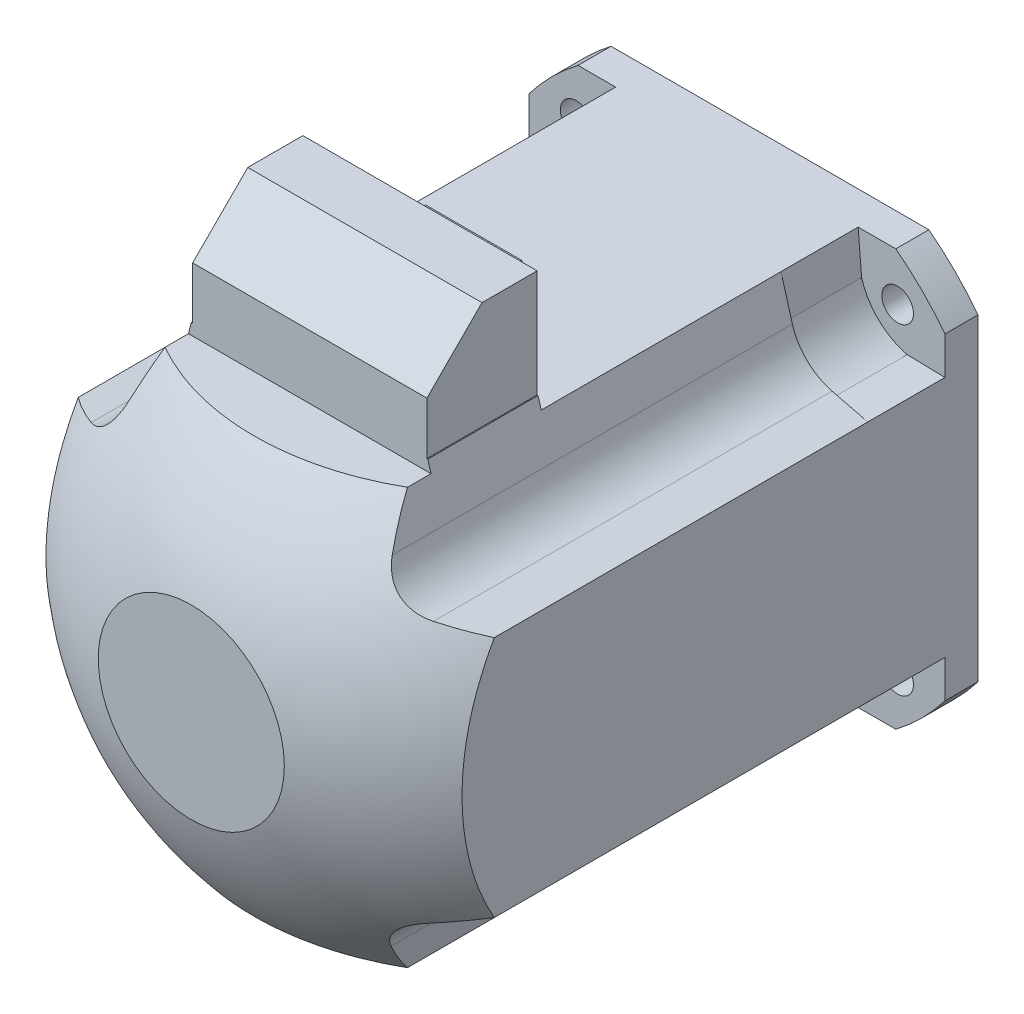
ISO-10303-21;
HEADER;
FILE_DESCRIPTION(('STEP AP214'),'2;1');
FILE_NAME('part.step','',(''),(''),'','','');
FILE_SCHEMA(('AUTOMOTIVE_DESIGN { 1 0 10303 214 1 1 1 1 }'));
ENDSEC;
DATA;
#1=APPLICATION_CONTEXT('core data for automotive mechanical design processes');
#2=APPLICATION_PROTOCOL_DEFINITION('international standard','automotive_design',2000,#1);
#3=PRODUCT_CONTEXT('',#1,'mechanical');
#4=PRODUCT('Part','Part','',(#3));
#5=PRODUCT_RELATED_PRODUCT_CATEGORY('part','',(#4));
#6=PRODUCT_DEFINITION_FORMATION('','',#4);
#7=PRODUCT_DEFINITION_CONTEXT('part definition',#1,'design');
#8=PRODUCT_DEFINITION('design','',#6,#7);
#9=PRODUCT_DEFINITION_SHAPE('','',#8);
#10=(LENGTH_UNIT() NAMED_UNIT(*) SI_UNIT(.MILLI.,.METRE.));
#11=(NAMED_UNIT(*) PLANE_ANGLE_UNIT() SI_UNIT($,.RADIAN.));
#12=(NAMED_UNIT(*) SI_UNIT($,.STERADIAN.) SOLID_ANGLE_UNIT());
#13=UNCERTAINTY_MEASURE_WITH_UNIT(LENGTH_MEASURE(1.E-05),#10,'distance_accuracy_value','');
#14=(GEOMETRIC_REPRESENTATION_CONTEXT(3) GLOBAL_UNCERTAINTY_ASSIGNED_CONTEXT((#13)) GLOBAL_UNIT_ASSIGNED_CONTEXT((#10,
#11,#12)) REPRESENTATION_CONTEXT('',''));
#15=CARTESIAN_POINT('',(0.,0.,0.));
#16=DIRECTION('',(0.,0.,1.));
#17=DIRECTION('',(1.,0.,0.));
#18=AXIS2_PLACEMENT_3D('',#15,#16,#17);
#19=CARTESIAN_POINT('',(0.,0.,0.));
#20=DIRECTION('',(0.,0.,1.));
#21=DIRECTION('',(1.,0.,0.));
#22=AXIS2_PLACEMENT_3D('',#19,#20,#21);
#23=PLANE('',#22);
#24=CARTESIAN_POINT('',(-58.3363094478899,-58.3363094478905,0.));
#25=DIRECTION('',(0.,0.,-1.));
#26=DIRECTION('',(0.,1.,0.));
#27=AXIS2_PLACEMENT_3D('',#24,#25,#26);
#28=CIRCLE('',#27,5.75);
#29=CARTESIAN_POINT('',(-58.3363094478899,-52.5863094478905,0.));
#30=VERTEX_POINT('',#29);
#31=EDGE_CURVE('E1579',#30,#30,#28,.T.);
#32=ORIENTED_EDGE('',*,*,#31,.F.);
#33=EDGE_LOOP('',(#32));
#34=FACE_BOUND('',#33,.T.);
#35=CARTESIAN_POINT('',(58.3363094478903,58.3363094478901,0.));
#36=DIRECTION('',(0.,0.,-1.));
#37=DIRECTION('',(-1.,0.,0.));
#38=AXIS2_PLACEMENT_3D('',#35,#36,#37);
#39=CIRCLE('',#38,5.75);
#40=CARTESIAN_POINT('',(52.5863094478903,58.3363094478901,0.));
#41=VERTEX_POINT('',#40);
#42=EDGE_CURVE('E806',#41,#41,#39,.T.);
#43=ORIENTED_EDGE('',*,*,#42,.F.);
#44=EDGE_LOOP('',(#43));
#45=FACE_BOUND('',#44,.T.);
#46=CARTESIAN_POINT('',(0.,0.,0.));
#47=DIRECTION('',(0.,0.,1.));
#48=DIRECTION('',(1.,0.,0.));
#49=AXIS2_PLACEMENT_3D('',#46,#47,#48);
#50=CIRCLE('',#49,95.);
#51=CARTESIAN_POINT('',(75.5,57.660645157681,0.));
#52=VERTEX_POINT('',#51);
#53=CARTESIAN_POINT('',(57.660645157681,75.5,0.));
#54=VERTEX_POINT('',#53);
#55=EDGE_CURVE('E619',#52,#54,#50,.T.);
#56=ORIENTED_EDGE('',*,*,#55,.F.);
#57=DIRECTION('',(0.,1.,0.));
#58=VECTOR('',#57,1.);
#59=CARTESIAN_POINT('',(75.5,57.660645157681,0.));
#60=LINE('',#59,#58);
#61=CARTESIAN_POINT('',(75.5,-57.660645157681,0.));
#62=VERTEX_POINT('',#61);
#63=EDGE_CURVE('E640',#62,#52,#60,.T.);
#64=ORIENTED_EDGE('',*,*,#63,.F.);
#65=CARTESIAN_POINT('',(0.,0.,0.));
#66=DIRECTION('',(0.,0.,1.));
#67=DIRECTION('',(1.,0.,0.));
#68=AXIS2_PLACEMENT_3D('',#65,#66,#67);
#69=CIRCLE('',#68,95.);
#70=CARTESIAN_POINT('',(57.6606451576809,-75.5,0.));
#71=VERTEX_POINT('',#70);
#72=EDGE_CURVE('E637',#71,#62,#69,.T.);
#73=ORIENTED_EDGE('',*,*,#72,.F.);
#74=DIRECTION('',(1.,0.,0.));
#75=VECTOR('',#74,1.);
#76=CARTESIAN_POINT('',(-57.660645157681,-75.5,0.));
#77=LINE('',#76,#75);
#78=CARTESIAN_POINT('',(-57.660645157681,-75.5,0.));
#79=VERTEX_POINT('',#78);
#80=EDGE_CURVE('E634',#79,#71,#77,.T.);
#81=ORIENTED_EDGE('',*,*,#80,.F.);
#82=CARTESIAN_POINT('',(0.,0.,0.));
#83=DIRECTION('',(0.,0.,1.));
#84=DIRECTION('',(1.,0.,0.));
#85=AXIS2_PLACEMENT_3D('',#82,#83,#84);
#86=CIRCLE('',#85,95.);
#87=CARTESIAN_POINT('',(-75.5,-57.660645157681,0.));
#88=VERTEX_POINT('',#87);
#89=EDGE_CURVE('E631',#88,#79,#86,.T.);
#90=ORIENTED_EDGE('',*,*,#89,.F.);
#91=DIRECTION('',(0.,-1.,0.));
#92=VECTOR('',#91,1.);
#93=CARTESIAN_POINT('',(-75.5,57.660645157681,0.));
#94=LINE('',#93,#92);
#95=CARTESIAN_POINT('',(-75.5,57.660645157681,0.));
#96=VERTEX_POINT('',#95);
#97=EDGE_CURVE('E628',#96,#88,#94,.T.);
#98=ORIENTED_EDGE('',*,*,#97,.F.);
#99=CARTESIAN_POINT('',(0.,0.,0.));
#100=DIRECTION('',(0.,0.,1.));
#101=DIRECTION('',(1.,0.,0.));
#102=AXIS2_PLACEMENT_3D('',#99,#100,#101);
#103=CIRCLE('',#102,95.);
#104=CARTESIAN_POINT('',(-57.660645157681,75.5,0.));
#105=VERTEX_POINT('',#104);
#106=EDGE_CURVE('E625',#105,#96,#103,.T.);
#107=ORIENTED_EDGE('',*,*,#106,.F.);
#108=DIRECTION('',(-1.,0.,0.));
#109=VECTOR('',#108,1.);
#110=CARTESIAN_POINT('',(-57.660645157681,75.5,0.));
#111=LINE('',#110,#109);
#112=EDGE_CURVE('E622',#54,#105,#111,.T.);
#113=ORIENTED_EDGE('',*,*,#112,.F.);
#114=EDGE_LOOP('',(#56,#64,#73,#81,#90,#98,#107,#113));
#115=FACE_BOUND('',#114,.T.);
#116=CARTESIAN_POINT('',(0.,0.,0.));
#117=DIRECTION('',(0.,0.,1.));
#118=DIRECTION('',(1.,0.,0.));
#119=AXIS2_PLACEMENT_3D('',#116,#117,#118);
#120=CIRCLE('',#119,65.);
#121=CARTESIAN_POINT('',(65.,0.,0.));
#122=VERTEX_POINT('',#121);
#123=EDGE_CURVE('E659',#122,#122,#120,.F.);
#124=ORIENTED_EDGE('',*,*,#123,.F.);
#125=EDGE_LOOP('',(#124));
#126=FACE_BOUND('',#125,.T.);
#127=CARTESIAN_POINT('',(-58.3363094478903,58.3363094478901,0.));
#128=DIRECTION('',(0.,0.,-1.));
#129=DIRECTION('',(0.,1.,0.));
#130=AXIS2_PLACEMENT_3D('',#127,#128,#129);
#131=CIRCLE('',#130,5.75);
#132=CARTESIAN_POINT('',(-58.3363094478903,64.0863094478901,0.));
#133=VERTEX_POINT('',#132);
#134=EDGE_CURVE('E1044',#133,#133,#131,.T.);
#135=ORIENTED_EDGE('',*,*,#134,.F.);
#136=EDGE_LOOP('',(#135));
#137=FACE_BOUND('',#136,.T.);
#138=CARTESIAN_POINT('',(58.3363094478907,-58.3363094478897,0.));
#139=DIRECTION('',(0.,0.,-1.));
#140=DIRECTION('',(0.,1.,0.));
#141=AXIS2_PLACEMENT_3D('',#138,#139,#140);
#142=CIRCLE('',#141,5.75);
#143=CARTESIAN_POINT('',(58.3363094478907,-52.5863094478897,0.));
#144=VERTEX_POINT('',#143);
#145=EDGE_CURVE('E1575',#144,#144,#142,.T.);
#146=ORIENTED_EDGE('',*,*,#145,.F.);
#147=EDGE_LOOP('',(#146));
#148=FACE_BOUND('',#147,.T.);
#149=ADVANCED_FACE('F16',(#34,#45,#115,#126,#137,#148),#23,.F.);
#150=CARTESIAN_POINT('',(-57.660645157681,75.5,220.));
#151=DIRECTION('',(0.,-1.,0.));
#152=DIRECTION('',(0.,0.,-1.));
#153=AXIS2_PLACEMENT_3D('',#150,#151,#152);
#154=PLANE('',#153);
#155=DIRECTION('',(1.,0.,0.));
#156=VECTOR('',#155,1.);
#157=CARTESIAN_POINT('',(42.5,75.5,167.));
#158=LINE('',#157,#156);
#159=CARTESIAN_POINT('',(-44.,75.5,167.));
#160=VERTEX_POINT('',#159);
#161=CARTESIAN_POINT('',(44.,75.5,167.));
#162=VERTEX_POINT('',#161);
#163=EDGE_CURVE('E365',#160,#162,#158,.T.);
#164=ORIENTED_EDGE('',*,*,#163,.F.);
#165=DIRECTION('',(0.,0.,-1.));
#166=VECTOR('',#165,1.);
#167=CARTESIAN_POINT('',(-44.,75.5,220.));
#168=LINE('',#167,#166);
#169=CARTESIAN_POINT('',(-44.,75.5,175.545441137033));
#170=VERTEX_POINT('',#169);
#171=EDGE_CURVE('E603',#170,#160,#168,.T.);
#172=ORIENTED_EDGE('',*,*,#171,.F.);
#173=CARTESIAN_POINT('',(0.,75.5,98.5));
#174=DIRECTION('',(0.,-1.,0.));
#175=DIRECTION('',(0.,0.,-1.));
#176=AXIS2_PLACEMENT_3D('',#173,#174,#175);
#177=CIRCLE('',#176,88.7242920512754);
#178=CARTESIAN_POINT('',(44.,75.5,175.545441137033));
#179=VERTEX_POINT('',#178);
#180=EDGE_CURVE('E975',#179,#170,#177,.T.);
#181=ORIENTED_EDGE('',*,*,#180,.F.);
#182=DIRECTION('',(0.,0.,-1.));
#183=VECTOR('',#182,1.);
#184=CARTESIAN_POINT('',(44.,75.5,220.));
#185=LINE('',#184,#183);
#186=EDGE_CURVE('E604',#179,#162,#185,.T.);
#187=ORIENTED_EDGE('',*,*,#186,.T.);
#188=EDGE_LOOP('',(#164,#172,#181,#187));
#189=FACE_BOUND('',#188,.T.);
#190=ADVANCED_FACE('F568',(#189),#154,.F.);
#191=DIRECTION('',(-1.,0.,0.));
#192=VECTOR('',#191,1.);
#193=CARTESIAN_POINT('',(42.5,75.5,127.));
#194=LINE('',#193,#192);
#195=CARTESIAN_POINT('',(44.,75.5,127.));
#196=VERTEX_POINT('',#195);
#197=CARTESIAN_POINT('',(-44.,75.5,127.));
#198=VERTEX_POINT('',#197);
#199=EDGE_CURVE('E459',#196,#198,#194,.T.);
#200=ORIENTED_EDGE('',*,*,#199,.F.);
#201=CARTESIAN_POINT('',(44.,75.5,40.));
#202=VERTEX_POINT('',#201);
#203=EDGE_CURVE('E843',#196,#202,#185,.T.);
#204=ORIENTED_EDGE('',*,*,#203,.T.);
#205=DIRECTION('',(0.,0.,-1.));
#206=VECTOR('',#205,1.);
#207=CARTESIAN_POINT('',(44.,75.5,40.));
#208=LINE('',#207,#206);
#209=CARTESIAN_POINT('',(44.,75.5,12.));
#210=VERTEX_POINT('',#209);
#211=EDGE_CURVE('E731',#202,#210,#208,.T.);
#212=ORIENTED_EDGE('',*,*,#211,.T.);
#213=DIRECTION('',(-1.,0.,0.));
#214=VECTOR('',#213,1.);
#215=CARTESIAN_POINT('',(57.6606451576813,75.5,12.));
#216=LINE('',#215,#214);
#217=CARTESIAN_POINT('',(57.6606451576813,75.5,12.));
#218=VERTEX_POINT('',#217);
#219=EDGE_CURVE('E838',#218,#210,#216,.T.);
#220=ORIENTED_EDGE('',*,*,#219,.F.);
#221=DIRECTION('',(0.,0.,-1.));
#222=VECTOR('',#221,1.);
#223=CARTESIAN_POINT('',(57.660645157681,75.5,220.));
#224=LINE('',#223,#222);
#225=EDGE_CURVE('E657',#218,#54,#224,.T.);
#226=ORIENTED_EDGE('',*,*,#225,.T.);
#227=ORIENTED_EDGE('',*,*,#112,.T.);
#228=DIRECTION('',(0.,0.,-1.));
#229=VECTOR('',#228,1.);
#230=CARTESIAN_POINT('',(-57.660645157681,75.5,220.));
#231=LINE('',#230,#229);
#232=CARTESIAN_POINT('',(-57.660645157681,75.5,12.));
#233=VERTEX_POINT('',#232);
#234=EDGE_CURVE('E655',#233,#105,#231,.T.);
#235=ORIENTED_EDGE('',*,*,#234,.F.);
#236=DIRECTION('',(-1.,0.,0.));
#237=VECTOR('',#236,1.);
#238=CARTESIAN_POINT('',(-44.,75.5,12.));
#239=LINE('',#238,#237);
#240=CARTESIAN_POINT('',(-44.,75.5,12.));
#241=VERTEX_POINT('',#240);
#242=EDGE_CURVE('E845',#241,#233,#239,.T.);
#243=ORIENTED_EDGE('',*,*,#242,.F.);
#244=DIRECTION('',(0.,0.,-1.));
#245=VECTOR('',#244,1.);
#246=CARTESIAN_POINT('',(-44.,75.5,40.));
#247=LINE('',#246,#245);
#248=CARTESIAN_POINT('',(-44.,75.5,40.));
#249=VERTEX_POINT('',#248);
#250=EDGE_CURVE('E704',#249,#241,#247,.T.);
#251=ORIENTED_EDGE('',*,*,#250,.F.);
#252=EDGE_CURVE('E609',#198,#249,#168,.T.);
#253=ORIENTED_EDGE('',*,*,#252,.F.);
#254=EDGE_LOOP('',(#200,#204,#212,#220,#226,#227,#235,#243,#251,#253));
#255=FACE_BOUND('',#254,.T.);
#256=ADVANCED_FACE('F592',(#255),#154,.F.);
#257=CARTESIAN_POINT('',(42.5,118.5,127.));
#258=DIRECTION('',(-1.,0.,0.));
#259=DIRECTION('',(0.,0.,1.));
#260=AXIS2_PLACEMENT_3D('',#257,#258,#259);
#261=PLANE('',#260);
#262=DIRECTION('',(0.,0.,1.));
#263=VECTOR('',#262,1.);
#264=CARTESIAN_POINT('',(42.5,79.5,127.));
#265=LINE('',#264,#263);
#266=CARTESIAN_POINT('',(42.5,79.5,127.));
#267=VERTEX_POINT('',#266);
#268=CARTESIAN_POINT('',(42.5,79.5,167.));
#269=VERTEX_POINT('',#268);
#270=EDGE_CURVE('E371',#267,#269,#265,.T.);
#271=ORIENTED_EDGE('',*,*,#270,.F.);
#272=DIRECTION('',(0.,-1.,0.));
#273=VECTOR('',#272,1.);
#274=CARTESIAN_POINT('',(42.5,118.5,127.));
#275=LINE('',#274,#273);
#276=CARTESIAN_POINT('',(42.5,118.5,127.));
#277=VERTEX_POINT('',#276);
#278=EDGE_CURVE('E477',#277,#267,#275,.T.);
#279=ORIENTED_EDGE('',*,*,#278,.F.);
#280=DIRECTION('',(0.,0.,-1.));
#281=VECTOR('',#280,1.);
#282=CARTESIAN_POINT('',(42.5,118.5,127.));
#283=LINE('',#282,#281);
#284=CARTESIAN_POINT('',(42.5,118.5,147.));
#285=VERTEX_POINT('',#284);
#286=EDGE_CURVE('E463',#285,#277,#283,.T.);
#287=ORIENTED_EDGE('',*,*,#286,.F.);
#288=DIRECTION('',(0.,0.707106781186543,-0.707106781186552));
#289=VECTOR('',#288,1.);
#290=CARTESIAN_POINT('',(42.5,98.5,167.));
#291=LINE('',#290,#289);
#292=CARTESIAN_POINT('',(42.5,98.5,167.));
#293=VERTEX_POINT('',#292);
#294=EDGE_CURVE('E451',#293,#285,#291,.T.);
#295=ORIENTED_EDGE('',*,*,#294,.F.);
#296=DIRECTION('',(0.,-1.,0.));
#297=VECTOR('',#296,1.);
#298=CARTESIAN_POINT('',(42.5,118.5,167.));
#299=LINE('',#298,#297);
#300=EDGE_CURVE('E470',#293,#269,#299,.T.);
#301=ORIENTED_EDGE('',*,*,#300,.T.);
#302=EDGE_LOOP('',(#271,#279,#287,#295,#301));
#303=FACE_BOUND('',#302,.T.);
#304=ADVANCED_FACE('F598',(#303),#261,.F.);
#305=CARTESIAN_POINT('',(-42.5,118.5,127.));
#306=DIRECTION('',(1.,0.,0.));
#307=DIRECTION('',(0.,0.,-1.));
#308=AXIS2_PLACEMENT_3D('',#305,#306,#307);
#309=PLANE('',#308);
#310=DIRECTION('',(0.,0.,-1.));
#311=VECTOR('',#310,1.);
#312=CARTESIAN_POINT('',(-42.5,79.5,127.));
#313=LINE('',#312,#311);
#314=CARTESIAN_POINT('',(-42.5,79.5,167.));
#315=VERTEX_POINT('',#314);
#316=CARTESIAN_POINT('',(-42.5,79.5,127.));
#317=VERTEX_POINT('',#316);
#318=EDGE_CURVE('E381',#315,#317,#313,.T.);
#319=ORIENTED_EDGE('',*,*,#318,.F.);
#320=DIRECTION('',(0.,-1.,0.));
#321=VECTOR('',#320,1.);
#322=CARTESIAN_POINT('',(-42.5,118.5,167.));
#323=LINE('',#322,#321);
#324=CARTESIAN_POINT('',(-42.5,98.5,167.));
#325=VERTEX_POINT('',#324);
#326=EDGE_CURVE('E472',#325,#315,#323,.T.);
#327=ORIENTED_EDGE('',*,*,#326,.F.);
#328=DIRECTION('',(0.,-0.707106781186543,0.707106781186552));
#329=VECTOR('',#328,1.);
#330=CARTESIAN_POINT('',(-42.5,98.5,167.));
#331=LINE('',#330,#329);
#332=CARTESIAN_POINT('',(-42.5,118.5,147.));
#333=VERTEX_POINT('',#332);
#334=EDGE_CURVE('E453',#333,#325,#331,.T.);
#335=ORIENTED_EDGE('',*,*,#334,.F.);
#336=DIRECTION('',(0.,0.,1.));
#337=VECTOR('',#336,1.);
#338=CARTESIAN_POINT('',(-42.5,118.5,127.));
#339=LINE('',#338,#337);
#340=CARTESIAN_POINT('',(-42.5,118.5,127.));
#341=VERTEX_POINT('',#340);
#342=EDGE_CURVE('E467',#341,#333,#339,.T.);
#343=ORIENTED_EDGE('',*,*,#342,.F.);
#344=DIRECTION('',(0.,-1.,0.));
#345=VECTOR('',#344,1.);
#346=CARTESIAN_POINT('',(-42.5,118.5,127.));
#347=LINE('',#346,#345);
#348=EDGE_CURVE('E475',#341,#317,#347,.T.);
#349=ORIENTED_EDGE('',*,*,#348,.T.);
#350=EDGE_LOOP('',(#319,#327,#335,#343,#349));
#351=FACE_BOUND('',#350,.T.);
#352=ADVANCED_FACE('F1055',(#351),#309,.F.);
#353=CARTESIAN_POINT('',(42.5,118.5,127.));
#354=DIRECTION('',(0.,0.,1.));
#355=DIRECTION('',(1.,0.,0.));
#356=AXIS2_PLACEMENT_3D('',#353,#354,#355);
#357=PLANE('',#356);
#358=DIRECTION('',(-1.,0.,0.));
#359=VECTOR('',#358,1.);
#360=CARTESIAN_POINT('',(44.,79.5,127.));
#361=LINE('',#360,#359);
#362=CARTESIAN_POINT('',(42.8489274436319,79.5,127.));
#363=VERTEX_POINT('',#362);
#364=EDGE_CURVE('E379',#363,#267,#361,.T.);
#365=ORIENTED_EDGE('',*,*,#364,.F.);
#366=DIRECTION('',(-0.276545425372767,0.961000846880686,0.));
#367=VECTOR('',#366,1.);
#368=CARTESIAN_POINT('',(44.,75.5,127.));
#369=LINE('',#368,#367);
#370=EDGE_CURVE('E353',#196,#363,#369,.T.);
#371=ORIENTED_EDGE('',*,*,#370,.F.);
#372=ORIENTED_EDGE('',*,*,#199,.T.);
#373=DIRECTION('',(-0.241005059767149,-0.970523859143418,0.));
#374=VECTOR('',#373,1.);
#375=CARTESIAN_POINT('',(-43.0067011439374,79.5,127.));
#376=LINE('',#375,#374);
#377=CARTESIAN_POINT('',(-43.0067011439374,79.5,127.));
#378=VERTEX_POINT('',#377);
#379=EDGE_CURVE('E32',#378,#198,#376,.T.);
#380=ORIENTED_EDGE('',*,*,#379,.F.);
#381=EDGE_CURVE('E374',#317,#378,#361,.T.);
#382=ORIENTED_EDGE('',*,*,#381,.F.);
#383=ORIENTED_EDGE('',*,*,#348,.F.);
#384=DIRECTION('',(-1.,0.,0.));
#385=VECTOR('',#384,1.);
#386=CARTESIAN_POINT('',(42.5,118.5,127.));
#387=LINE('',#386,#385);
#388=EDGE_CURVE('E465',#277,#341,#387,.T.);
#389=ORIENTED_EDGE('',*,*,#388,.F.);
#390=ORIENTED_EDGE('',*,*,#278,.T.);
#391=EDGE_LOOP('',(#365,#371,#372,#380,#382,#383,#389,#390));
#392=FACE_BOUND('',#391,.T.);
#393=DIRECTION('',(0.,-1.,0.));
#394=VECTOR('',#393,1.);
#395=CARTESIAN_POINT('',(-6.5,114.5,127.));
#396=LINE('',#395,#394);
#397=CARTESIAN_POINT('',(-6.5,114.5,127.));
#398=VERTEX_POINT('',#397);
#399=CARTESIAN_POINT('',(-6.5,88.5,127.));
#400=VERTEX_POINT('',#399);
#401=EDGE_CURVE('E385',#398,#400,#396,.T.);
#402=ORIENTED_EDGE('',*,*,#401,.F.);
#403=DIRECTION('',(1.,0.,0.));
#404=VECTOR('',#403,1.);
#405=CARTESIAN_POINT('',(-6.5,114.5,127.));
#406=LINE('',#405,#404);
#407=CARTESIAN_POINT('',(-32.5,114.5,127.));
#408=VERTEX_POINT('',#407);
#409=EDGE_CURVE('E394',#408,#398,#406,.T.);
#410=ORIENTED_EDGE('',*,*,#409,.F.);
#411=DIRECTION('',(0.,1.,0.));
#412=VECTOR('',#411,1.);
#413=CARTESIAN_POINT('',(-32.5,114.5,127.));
#414=LINE('',#413,#412);
#415=CARTESIAN_POINT('',(-32.5,88.5,127.));
#416=VERTEX_POINT('',#415);
#417=EDGE_CURVE('E391',#416,#408,#414,.T.);
#418=ORIENTED_EDGE('',*,*,#417,.F.);
#419=DIRECTION('',(-1.,0.,0.));
#420=VECTOR('',#419,1.);
#421=CARTESIAN_POINT('',(-6.5,88.5,127.));
#422=LINE('',#421,#420);
#423=EDGE_CURVE('E388',#400,#416,#422,.T.);
#424=ORIENTED_EDGE('',*,*,#423,.F.);
#425=EDGE_LOOP('',(#402,#410,#418,#424));
#426=FACE_BOUND('',#425,.T.);
#427=DIRECTION('',(0.,-1.,0.));
#428=VECTOR('',#427,1.);
#429=CARTESIAN_POINT('',(33.,115.,127.));
#430=LINE('',#429,#428);
#431=CARTESIAN_POINT('',(33.,115.,127.));
#432=VERTEX_POINT('',#431);
#433=CARTESIAN_POINT('',(33.,80.,127.));
#434=VERTEX_POINT('',#433);
#435=EDGE_CURVE('E418',#432,#434,#430,.T.);
#436=ORIENTED_EDGE('',*,*,#435,.F.);
#437=DIRECTION('',(1.,0.,0.));
#438=VECTOR('',#437,1.);
#439=CARTESIAN_POINT('',(33.,115.,127.));
#440=LINE('',#439,#438);
#441=CARTESIAN_POINT('',(-2.00000000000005,115.,127.));
#442=VERTEX_POINT('',#441);
#443=EDGE_CURVE('E427',#442,#432,#440,.T.);
#444=ORIENTED_EDGE('',*,*,#443,.F.);
#445=DIRECTION('',(0.,1.,0.));
#446=VECTOR('',#445,1.);
#447=CARTESIAN_POINT('',(-2.00000000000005,115.,127.));
#448=LINE('',#447,#446);
#449=CARTESIAN_POINT('',(-2.00000000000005,80.,127.));
#450=VERTEX_POINT('',#449);
#451=EDGE_CURVE('E424',#450,#442,#448,.T.);
#452=ORIENTED_EDGE('',*,*,#451,.F.);
#453=DIRECTION('',(-1.,0.,0.));
#454=VECTOR('',#453,1.);
#455=CARTESIAN_POINT('',(33.,80.,127.));
#456=LINE('',#455,#454);
#457=EDGE_CURVE('E421',#434,#450,#456,.T.);
#458=ORIENTED_EDGE('',*,*,#457,.F.);
#459=EDGE_LOOP('',(#436,#444,#452,#458));
#460=FACE_BOUND('',#459,.T.);
#461=ADVANCED_FACE('F515',(#392,#426,#460),#357,.F.);
#462=CARTESIAN_POINT('',(0.,0.,98.5));
#463=DIRECTION('',(0.,0.,-1.));
#464=DIRECTION('',(1.,0.,0.));
#465=AXIS2_PLACEMENT_3D('',#462,#463,#464);
#466=SPHERICAL_SURFACE('',#465,116.5);
#467=CARTESIAN_POINT('',(62.5449317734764,47.2170636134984,184.702844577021));
#468=CARTESIAN_POINT('',(62.1707757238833,47.3099556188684,184.923441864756));
#469=CARTESIAN_POINT('',(61.7944370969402,47.4149082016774,185.135568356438));
#470=CARTESIAN_POINT('',(61.0390877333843,47.6501977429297,185.541001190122));
#471=CARTESIAN_POINT('',(60.6600747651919,47.7805591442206,185.734289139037));
#472=CARTESIAN_POINT('',(59.8991682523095,48.0687516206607,186.101000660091));
#473=CARTESIAN_POINT('',(59.5172729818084,48.2267671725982,186.274276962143));
#474=CARTESIAN_POINT('',(58.7559756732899,48.5704059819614,186.597113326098));
#475=CARTESIAN_POINT('',(58.3765729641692,48.7560214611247,186.746680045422));
#476=CARTESIAN_POINT('',(57.6208697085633,49.1564966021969,187.020772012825));
#477=CARTESIAN_POINT('',(57.2446021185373,49.3715274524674,187.145139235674));
#478=CARTESIAN_POINT('',(56.5009386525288,49.8297771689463,187.365573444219));
#479=CARTESIAN_POINT('',(56.13354347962,50.0729982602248,187.461638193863));
#480=CARTESIAN_POINT('',(55.4125589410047,50.5858272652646,187.623363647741));
#481=CARTESIAN_POINT('',(55.0589269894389,50.8553429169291,187.689126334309));
#482=CARTESIAN_POINT('',(54.3678769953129,51.4197609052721,187.789381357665));
#483=CARTESIAN_POINT('',(54.0304568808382,51.7146599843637,187.823877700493));
#484=CARTESIAN_POINT('',(53.4061624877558,52.2985754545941,187.859141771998));
#485=CARTESIAN_POINT('',(53.1175196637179,52.5855340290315,187.862777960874));
#486=CARTESIAN_POINT('',(52.5587016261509,53.1760593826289,187.843745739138));
#487=CARTESIAN_POINT('',(52.2885253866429,53.4796252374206,187.821078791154));
#488=CARTESIAN_POINT('',(51.7683118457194,54.1011018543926,187.749808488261));
#489=CARTESIAN_POINT('',(51.518293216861,54.4190255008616,187.701181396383));
#490=CARTESIAN_POINT('',(51.0401018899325,55.0662304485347,187.57880716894));
#491=CARTESIAN_POINT('',(50.8119288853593,55.3955115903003,187.505060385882));
#492=CARTESIAN_POINT('',(50.3868420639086,56.0495954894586,187.336996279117));
#493=CARTESIAN_POINT('',(50.1890538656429,56.3740683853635,187.243597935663));
#494=CARTESIAN_POINT('',(49.8148432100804,57.0286321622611,187.035978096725));
#495=CARTESIAN_POINT('',(49.6384225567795,57.3587235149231,186.921754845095));
#496=CARTESIAN_POINT('',(49.3070487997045,58.0221345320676,186.673973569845));
#497=CARTESIAN_POINT('',(49.1520851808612,58.3554525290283,186.540425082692));
#498=CARTESIAN_POINT('',(48.8632297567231,59.0234432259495,186.255459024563));
#499=CARTESIAN_POINT('',(48.7293325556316,59.358115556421,186.104046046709));
#500=CARTESIAN_POINT('',(48.5188707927,59.9274112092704,185.832409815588));
#501=CARTESIAN_POINT('',(48.4371123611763,60.1621260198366,185.716339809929));
#502=CARTESIAN_POINT('',(48.2835860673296,60.6303750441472,185.476881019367));
#503=CARTESIAN_POINT('',(48.2117962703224,60.8639107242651,185.353509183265));
#504=CARTESIAN_POINT('',(48.1447584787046,61.0968819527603,185.226600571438));
#505=B_SPLINE_CURVE_WITH_KNOTS('',3,(#467,#468,#469,#470,#471,#472,#473,#474,#475,#476,#477,
#478,#479,#480,#481,#482,#483,#484,#485,#486,#487,#488,#489,#490,#491,#492,#493,#494,#495,#496,
#497,#498,#499,#500,#501,#502,#503,#504),.UNSPECIFIED.,.F.,.F.,(4,2,2,2,2,2,2,2,2,2,2,2,2,2,2,2,
2,2,4),(0.,1.33248334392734,2.66625489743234,4.0092888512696,5.35194502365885,6.70277674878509,
8.05371516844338,9.40007315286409,10.7462586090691,11.965765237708,13.1852040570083,
14.4057597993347,15.626298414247,16.7990246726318,17.9718498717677,19.1440982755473,
20.3160459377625,21.1387193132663,21.959552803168),.UNSPECIFIED.);
#506=CARTESIAN_POINT('',(62.5447317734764,47.2171132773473,184.702962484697));
#507=VERTEX_POINT('',#506);
#508=CARTESIAN_POINT('',(48.1448160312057,61.0966819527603,185.226709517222));
#509=VERTEX_POINT('',#508);
#510=EDGE_CURVE('E981',#507,#509,#505,.T.);
#511=ORIENTED_EDGE('',*,*,#510,.T.);
#512=CARTESIAN_POINT('',(60.6999049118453,17.4674986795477,98.5));
#513=DIRECTION('',(0.961000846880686,0.276545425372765,0.));
#514=DIRECTION('',(-0.276545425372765,0.961000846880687,0.));
#515=AXIS2_PLACEMENT_3D('',#512,#513,#514);
#516=CIRCLE('',#515,97.891051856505);
#517=EDGE_CURVE('E977',#179,#509,#516,.T.);
#518=ORIENTED_EDGE('',*,*,#517,.F.);
#519=ORIENTED_EDGE('',*,*,#180,.T.);
#520=CARTESIAN_POINT('',(-59.1038663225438,14.6769507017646,98.5));
#521=DIRECTION('',(-0.970523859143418,0.24100505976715,0.));
#522=DIRECTION('',(-0.24100505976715,-0.970523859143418,0.));
#523=AXIS2_PLACEMENT_3D('',#520,#521,#522);
#524=CIRCLE('',#523,99.3155078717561);
#525=CARTESIAN_POINT('',(-47.2171132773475,62.5447317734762,184.702962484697));
#526=VERTEX_POINT('',#525);
#527=EDGE_CURVE('E535',#526,#170,#524,.T.);
#528=ORIENTED_EDGE('',*,*,#527,.F.);
#529=CARTESIAN_POINT('',(-47.2170636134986,62.5449317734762,184.702844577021));
#530=CARTESIAN_POINT('',(-47.3099556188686,62.1707757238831,184.923441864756));
#531=CARTESIAN_POINT('',(-47.4149082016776,61.79443709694,185.135568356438));
#532=CARTESIAN_POINT('',(-47.6501977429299,61.0390877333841,185.541001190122));
#533=CARTESIAN_POINT('',(-47.7805591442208,60.6600747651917,185.734289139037));
#534=CARTESIAN_POINT('',(-48.0687516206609,59.8991682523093,186.101000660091));
#535=CARTESIAN_POINT('',(-48.2267671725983,59.5172729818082,186.274276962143));
#536=CARTESIAN_POINT('',(-48.5704059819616,58.7559756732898,186.597113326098));
#537=CARTESIAN_POINT('',(-48.7560214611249,58.3765729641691,186.746680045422));
#538=CARTESIAN_POINT('',(-49.1564966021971,57.6208697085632,187.020772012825));
#539=CARTESIAN_POINT('',(-49.3715274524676,57.2446021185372,187.145139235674));
#540=CARTESIAN_POINT('',(-49.8297771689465,56.5009386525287,187.365573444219));
#541=CARTESIAN_POINT('',(-50.0729982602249,56.1335434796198,187.461638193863));
#542=CARTESIAN_POINT('',(-50.5858272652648,55.4125589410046,187.623363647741));
#543=CARTESIAN_POINT('',(-50.8553429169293,55.0589269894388,187.689126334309));
#544=CARTESIAN_POINT('',(-51.4197609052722,54.3678769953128,187.789381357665));
#545=CARTESIAN_POINT('',(-51.7146599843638,54.0304568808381,187.823877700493));
#546=CARTESIAN_POINT('',(-52.2985754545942,53.4061624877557,187.859141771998));
#547=CARTESIAN_POINT('',(-52.5855340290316,53.1175196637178,187.862777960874));
#548=CARTESIAN_POINT('',(-53.1760593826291,52.5587016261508,187.843745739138));
#549=CARTESIAN_POINT('',(-53.4796252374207,52.2885253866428,187.821078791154));
#550=CARTESIAN_POINT('',(-54.1011018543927,51.7683118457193,187.749808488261));
#551=CARTESIAN_POINT('',(-54.4190255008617,51.5182932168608,187.701181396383));
#552=CARTESIAN_POINT('',(-55.0662304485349,51.0401018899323,187.57880716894));
#553=CARTESIAN_POINT('',(-55.3955115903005,50.8119288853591,187.505060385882));
#554=CARTESIAN_POINT('',(-56.0495954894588,50.3868420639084,187.336996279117));
#555=CARTESIAN_POINT('',(-56.3740683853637,50.1890538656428,187.243597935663));
#556=CARTESIAN_POINT('',(-57.0286321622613,49.8148432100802,187.035978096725));
#557=CARTESIAN_POINT('',(-57.3587235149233,49.6384225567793,186.921754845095));
#558=CARTESIAN_POINT('',(-58.0221345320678,49.3070487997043,186.673973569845));
#559=CARTESIAN_POINT('',(-58.3554525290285,49.1520851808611,186.540425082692));
#560=CARTESIAN_POINT('',(-59.0234432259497,48.8632297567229,186.255459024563));
#561=CARTESIAN_POINT('',(-59.3581155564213,48.7293325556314,186.104046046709));
#562=CARTESIAN_POINT('',(-59.9274112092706,48.5188707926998,185.832409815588));
#563=CARTESIAN_POINT('',(-60.1621260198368,48.4371123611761,185.716339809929));
#564=CARTESIAN_POINT('',(-60.6303750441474,48.2835860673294,185.476881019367));
#565=CARTESIAN_POINT('',(-60.8639107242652,48.2117962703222,185.353509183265));
#566=CARTESIAN_POINT('',(-61.0968819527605,48.1447584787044,185.226600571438));
#567=B_SPLINE_CURVE_WITH_KNOTS('',3,(#529,#530,#531,#532,#533,#534,#535,#536,#537,#538,#539,
#540,#541,#542,#543,#544,#545,#546,#547,#548,#549,#550,#551,#552,#553,#554,#555,#556,#557,#558,
#559,#560,#561,#562,#563,#564,#565,#566),.UNSPECIFIED.,.F.,.F.,(4,2,2,2,2,2,2,2,2,2,2,2,2,2,2,2,
2,2,4),(0.,1.33248334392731,2.66625489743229,4.00928885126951,5.35194502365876,6.70277674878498,
8.05371516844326,9.40007315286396,10.7462586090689,11.9657652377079,13.1852040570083,
14.4057597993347,15.626298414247,16.7990246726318,17.9718498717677,19.1440982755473,
20.3160459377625,21.1387193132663,21.959552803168),.UNSPECIFIED.);
#568=CARTESIAN_POINT('',(-61.0966819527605,48.1448160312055,185.226709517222));
#569=VERTEX_POINT('',#568);
#570=EDGE_CURVE('E529',#526,#569,#567,.T.);
#571=ORIENTED_EDGE('',*,*,#570,.T.);
#572=CARTESIAN_POINT('',(-17.4674986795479,60.6999049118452,98.5));
#573=DIRECTION('',(-0.276545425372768,0.961000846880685,0.));
#574=DIRECTION('',(-0.961000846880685,-0.276545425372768,0.));
#575=AXIS2_PLACEMENT_3D('',#572,#573,#574);
#576=CIRCLE('',#575,97.891051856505);
#577=CARTESIAN_POINT('',(-75.5,44.,175.545441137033));
#578=VERTEX_POINT('',#577);
#579=EDGE_CURVE('E493',#578,#569,#576,.T.);
#580=ORIENTED_EDGE('',*,*,#579,.F.);
#581=CARTESIAN_POINT('',(-75.5,0.,98.5));
#582=DIRECTION('',(1.,0.,0.));
#583=DIRECTION('',(0.,0.,-1.));
#584=AXIS2_PLACEMENT_3D('',#581,#582,#583);
#585=CIRCLE('',#584,88.7242920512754);
#586=CARTESIAN_POINT('',(-75.5,-43.9999999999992,175.545441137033));
#587=VERTEX_POINT('',#586);
#588=EDGE_CURVE('E486',#578,#587,#585,.T.);
#589=ORIENTED_EDGE('',*,*,#588,.T.);
#590=CARTESIAN_POINT('',(-14.6769507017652,-59.1038663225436,98.5));
#591=DIRECTION('',(-0.241005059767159,-0.970523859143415,0.));
#592=DIRECTION('',(0.970523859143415,-0.241005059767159,0.));
#593=AXIS2_PLACEMENT_3D('',#590,#591,#592);
#594=CIRCLE('',#593,99.3155078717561);
#595=CARTESIAN_POINT('',(-62.5447317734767,-47.2171132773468,184.702962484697));
#596=VERTEX_POINT('',#595);
#597=EDGE_CURVE('E480',#596,#587,#594,.T.);
#598=ORIENTED_EDGE('',*,*,#597,.F.);
#599=CARTESIAN_POINT('',(-62.5449317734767,-47.2170636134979,184.702844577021));
#600=CARTESIAN_POINT('',(-62.1707757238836,-47.309955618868,184.923441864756));
#601=CARTESIAN_POINT('',(-61.7944370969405,-47.4149082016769,185.135568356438));
#602=CARTESIAN_POINT('',(-61.0390877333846,-47.6501977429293,185.541001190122));
#603=CARTESIAN_POINT('',(-60.6600747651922,-47.7805591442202,185.734289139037));
#604=CARTESIAN_POINT('',(-59.8991682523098,-48.0687516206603,186.101000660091));
#605=CARTESIAN_POINT('',(-59.5172729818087,-48.2267671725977,186.274276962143));
#606=CARTESIAN_POINT('',(-58.7559756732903,-48.5704059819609,186.597113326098));
#607=CARTESIAN_POINT('',(-58.3765729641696,-48.7560214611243,186.746680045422));
#608=CARTESIAN_POINT('',(-57.6208697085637,-49.1564966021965,187.020772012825));
#609=CARTESIAN_POINT('',(-57.2446021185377,-49.371527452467,187.145139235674));
#610=CARTESIAN_POINT('',(-56.5009386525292,-49.8297771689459,187.365573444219));
#611=CARTESIAN_POINT('',(-56.1335434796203,-50.0729982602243,187.461638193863));
#612=CARTESIAN_POINT('',(-55.4125589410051,-50.5858272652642,187.623363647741));
#613=CARTESIAN_POINT('',(-55.0589269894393,-50.8553429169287,187.689126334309));
#614=CARTESIAN_POINT('',(-54.3678769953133,-51.4197609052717,187.789381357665));
#615=CARTESIAN_POINT('',(-54.0304568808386,-51.7146599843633,187.823877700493));
#616=CARTESIAN_POINT('',(-53.4061624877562,-52.2985754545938,187.859141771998));
#617=CARTESIAN_POINT('',(-53.1175196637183,-52.5855340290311,187.862777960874));
#618=CARTESIAN_POINT('',(-52.5587016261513,-53.1760593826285,187.843745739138));
#619=CARTESIAN_POINT('',(-52.2885253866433,-53.4796252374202,187.821078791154));
#620=CARTESIAN_POINT('',(-51.7683118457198,-54.1011018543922,187.749808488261));
#621=CARTESIAN_POINT('',(-51.5182932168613,-54.4190255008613,187.701181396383));
#622=CARTESIAN_POINT('',(-51.0401018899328,-55.0662304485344,187.57880716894));
#623=CARTESIAN_POINT('',(-50.8119288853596,-55.3955115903,187.505060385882));
#624=CARTESIAN_POINT('',(-50.386842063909,-56.0495954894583,187.336996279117));
#625=CARTESIAN_POINT('',(-50.1890538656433,-56.3740683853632,187.243597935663));
#626=CARTESIAN_POINT('',(-49.8148432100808,-57.0286321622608,187.035978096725));
#627=CARTESIAN_POINT('',(-49.6384225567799,-57.3587235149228,186.921754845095));
#628=CARTESIAN_POINT('',(-49.3070487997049,-58.0221345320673,186.673973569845));
#629=CARTESIAN_POINT('',(-49.1520851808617,-58.355452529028,186.540425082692));
#630=CARTESIAN_POINT('',(-48.8632297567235,-59.0234432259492,186.255459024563));
#631=CARTESIAN_POINT('',(-48.729332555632,-59.3581155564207,186.104046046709));
#632=CARTESIAN_POINT('',(-48.5188707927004,-59.9274112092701,185.832409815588));
#633=CARTESIAN_POINT('',(-48.4371123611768,-60.1621260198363,185.716339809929));
#634=CARTESIAN_POINT('',(-48.28358606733,-60.6303750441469,185.476881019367));
#635=CARTESIAN_POINT('',(-48.2117962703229,-60.8639107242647,185.353509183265));
#636=CARTESIAN_POINT('',(-48.1447584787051,-61.09688195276,185.226600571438));
#637=B_SPLINE_CURVE_WITH_KNOTS('',3,(#599,#600,#601,#602,#603,#604,#605,#606,#607,#608,#609,
#610,#611,#612,#613,#614,#615,#616,#617,#618,#619,#620,#621,#622,#623,#624,#625,#626,#627,#628,
#629,#630,#631,#632,#633,#634,#635,#636),.UNSPECIFIED.,.F.,.F.,(4,2,2,2,2,2,2,2,2,2,2,2,2,2,2,2,
2,2,4),(0.,1.33248334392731,2.66625489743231,4.00928885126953,5.35194502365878,6.70277674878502,
8.05371516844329,9.40007315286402,10.746258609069,11.965765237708,13.1852040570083,
14.4057597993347,15.626298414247,16.7990246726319,17.9718498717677,19.1440982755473,
20.3160459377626,21.1387193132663,21.959552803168),.UNSPECIFIED.);
#638=CARTESIAN_POINT('',(-48.1448160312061,-61.09668195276,185.226709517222));
#639=VERTEX_POINT('',#638);
#640=EDGE_CURVE('E11',#596,#639,#637,.T.);
#641=ORIENTED_EDGE('',*,*,#640,.T.);
#642=CARTESIAN_POINT('',(-60.6999049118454,-17.4674986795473,98.5));
#643=DIRECTION('',(-0.961000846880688,-0.276545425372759,0.));
#644=DIRECTION('',(0.276545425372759,-0.961000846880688,0.));
#645=AXIS2_PLACEMENT_3D('',#642,#643,#644);
#646=CIRCLE('',#645,97.891051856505);
#647=CARTESIAN_POINT('',(-44.0000000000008,-75.5,175.545441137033));
#648=VERTEX_POINT('',#647);
#649=EDGE_CURVE('E483',#648,#639,#646,.T.);
#650=ORIENTED_EDGE('',*,*,#649,.F.);
#651=CARTESIAN_POINT('',(0.,-75.5,98.5));
#652=DIRECTION('',(0.,1.,0.));
#653=DIRECTION('',(0.,0.,1.));
#654=AXIS2_PLACEMENT_3D('',#651,#652,#653);
#655=CIRCLE('',#654,88.7242920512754);
#656=CARTESIAN_POINT('',(43.9999999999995,-75.5,175.545441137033));
#657=VERTEX_POINT('',#656);
#658=EDGE_CURVE('E488',#648,#657,#655,.T.);
#659=ORIENTED_EDGE('',*,*,#658,.T.);
#660=CARTESIAN_POINT('',(59.1038663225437,-14.676950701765,98.5));
#661=DIRECTION('',(0.970523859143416,-0.241005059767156,0.));
#662=DIRECTION('',(0.241005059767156,0.970523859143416,0.));
#663=AXIS2_PLACEMENT_3D('',#660,#661,#662);
#664=CIRCLE('',#663,99.3155078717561);
#665=CARTESIAN_POINT('',(47.217113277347,-62.5447317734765,184.702962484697));
#666=VERTEX_POINT('',#665);
#667=EDGE_CURVE('E490',#666,#657,#664,.T.);
#668=ORIENTED_EDGE('',*,*,#667,.F.);
#669=CARTESIAN_POINT('',(47.2170636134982,-62.5449317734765,184.702844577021));
#670=CARTESIAN_POINT('',(47.3099556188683,-62.1707757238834,184.923441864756));
#671=CARTESIAN_POINT('',(47.4149082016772,-61.7944370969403,185.135568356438));
#672=CARTESIAN_POINT('',(47.6501977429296,-61.0390877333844,185.541001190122));
#673=CARTESIAN_POINT('',(47.7805591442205,-60.660074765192,185.734289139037));
#674=CARTESIAN_POINT('',(48.0687516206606,-59.8991682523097,186.101000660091));
#675=CARTESIAN_POINT('',(48.226767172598,-59.5172729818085,186.274276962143));
#676=CARTESIAN_POINT('',(48.5704059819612,-58.7559756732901,186.597113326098));
#677=CARTESIAN_POINT('',(48.7560214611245,-58.3765729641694,186.746680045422));
#678=CARTESIAN_POINT('',(49.1564966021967,-57.6208697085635,187.020772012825));
#679=CARTESIAN_POINT('',(49.3715274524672,-57.2446021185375,187.145139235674));
#680=CARTESIAN_POINT('',(49.8297771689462,-56.500938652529,187.365573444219));
#681=CARTESIAN_POINT('',(50.0729982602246,-56.1335434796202,187.461638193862));
#682=CARTESIAN_POINT('',(50.5858272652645,-55.4125589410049,187.623363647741));
#683=CARTESIAN_POINT('',(50.855342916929,-55.0589269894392,187.689126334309));
#684=CARTESIAN_POINT('',(51.4197609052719,-54.3678769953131,187.789381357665));
#685=CARTESIAN_POINT('',(51.7146599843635,-54.0304568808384,187.823877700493));
#686=CARTESIAN_POINT('',(52.298575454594,-53.406162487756,187.859141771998));
#687=CARTESIAN_POINT('',(52.5855340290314,-53.1175196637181,187.862777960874));
#688=CARTESIAN_POINT('',(53.1760593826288,-52.5587016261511,187.843745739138));
#689=CARTESIAN_POINT('',(53.4796252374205,-52.2885253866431,187.821078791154));
#690=CARTESIAN_POINT('',(54.1011018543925,-51.7683118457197,187.749808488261));
#691=CARTESIAN_POINT('',(54.4190255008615,-51.5182932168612,187.701181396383));
#692=CARTESIAN_POINT('',(55.0662304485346,-51.0401018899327,187.57880716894));
#693=CARTESIAN_POINT('',(55.3955115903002,-50.8119288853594,187.505060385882));
#694=CARTESIAN_POINT('',(56.0495954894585,-50.3868420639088,187.336996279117));
#695=CARTESIAN_POINT('',(56.3740683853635,-50.1890538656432,187.243597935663));
#696=CARTESIAN_POINT('',(57.028632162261,-49.8148432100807,187.035978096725));
#697=CARTESIAN_POINT('',(57.358723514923,-49.6384225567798,186.921754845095));
#698=CARTESIAN_POINT('',(58.0221345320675,-49.3070487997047,186.673973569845));
#699=CARTESIAN_POINT('',(58.3554525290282,-49.1520851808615,186.540425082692));
#700=CARTESIAN_POINT('',(59.0234432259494,-48.8632297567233,186.255459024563));
#701=CARTESIAN_POINT('',(59.358115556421,-48.7293325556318,186.104046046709));
#702=CARTESIAN_POINT('',(59.9274112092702,-48.5188707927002,185.832409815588));
#703=CARTESIAN_POINT('',(60.1621260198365,-48.4371123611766,185.716339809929));
#704=CARTESIAN_POINT('',(60.630375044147,-48.2835860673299,185.476881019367));
#705=CARTESIAN_POINT('',(60.8639107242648,-48.2117962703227,185.353509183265));
#706=CARTESIAN_POINT('',(61.0968819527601,-48.1447584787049,185.226600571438));
#707=B_SPLINE_CURVE_WITH_KNOTS('',3,(#669,#670,#671,#672,#673,#674,#675,#676,#677,#678,#679,
#680,#681,#682,#683,#684,#685,#686,#687,#688,#689,#690,#691,#692,#693,#694,#695,#696,#697,#698,
#699,#700,#701,#702,#703,#704,#705,#706),.UNSPECIFIED.,.F.,.F.,(4,2,2,2,2,2,2,2,2,2,2,2,2,2,2,2,
2,2,4),(0.,1.33248334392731,2.6662548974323,4.00928885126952,5.35194502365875,6.70277674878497,
8.05371516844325,9.40007315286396,10.746258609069,11.9657652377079,13.1852040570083,
14.4057597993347,15.626298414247,16.7990246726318,17.9718498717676,19.1440982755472,
20.3160459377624,21.1387193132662,21.9595528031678),.UNSPECIFIED.);
#708=CARTESIAN_POINT('',(61.0966819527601,-48.1448160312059,185.226709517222));
#709=VERTEX_POINT('',#708);
#710=EDGE_CURVE('E496',#666,#709,#707,.T.);
#711=ORIENTED_EDGE('',*,*,#710,.T.);
#712=CARTESIAN_POINT('',(17.4674986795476,-60.6999049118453,98.5));
#713=DIRECTION('',(0.276545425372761,-0.961000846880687,0.));
#714=DIRECTION('',(0.961000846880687,0.276545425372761,0.));
#715=AXIS2_PLACEMENT_3D('',#712,#713,#714);
#716=CIRCLE('',#715,97.891051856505);
#717=CARTESIAN_POINT('',(75.5,-44.0000000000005,175.545441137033));
#718=VERTEX_POINT('',#717);
#719=EDGE_CURVE('E503',#718,#709,#716,.T.);
#720=ORIENTED_EDGE('',*,*,#719,.F.);
#721=CARTESIAN_POINT('',(75.5,0.,98.5));
#722=DIRECTION('',(-1.,0.,0.));
#723=DIRECTION('',(0.,0.,1.));
#724=AXIS2_PLACEMENT_3D('',#721,#722,#723);
#725=CIRCLE('',#724,88.7242920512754);
#726=CARTESIAN_POINT('',(75.5,44.,175.545441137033));
#727=VERTEX_POINT('',#726);
#728=EDGE_CURVE('E970',#718,#727,#725,.T.);
#729=ORIENTED_EDGE('',*,*,#728,.T.);
#730=CARTESIAN_POINT('',(14.6769507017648,59.1038663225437,98.5));
#731=DIRECTION('',(0.241005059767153,0.970523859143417,0.));
#732=DIRECTION('',(-0.970523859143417,0.241005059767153,0.));
#733=AXIS2_PLACEMENT_3D('',#730,#731,#732);
#734=CIRCLE('',#733,99.3155078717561);
#735=EDGE_CURVE('E974',#507,#727,#734,.T.);
#736=ORIENTED_EDGE('',*,*,#735,.F.);
#737=EDGE_LOOP('',(#511,#518,#519,#528,#571,#580,#589,#598,#641,#650,#659,#668,#711,#720,#729,#736));
#738=FACE_BOUND('',#737,.T.);
#739=CARTESIAN_POINT('',(0.,0.,210.));
#740=DIRECTION('',(0.,0.,1.));
#741=DIRECTION('',(1.,0.,0.));
#742=AXIS2_PLACEMENT_3D('',#739,#740,#741);
#743=CIRCLE('',#742,33.7638860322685);
#744=CARTESIAN_POINT('',(33.7638860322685,0.,210.));
#745=VERTEX_POINT('',#744);
#746=EDGE_CURVE('E20',#745,#745,#743,.F.);
#747=ORIENTED_EDGE('',*,*,#746,.T.);
#748=EDGE_LOOP('',(#747));
#749=FACE_BOUND('',#748,.T.);
#750=ADVANCED_FACE('F509',(#738,#749),#466,.T.);
#751=CARTESIAN_POINT('',(-57.660645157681,-75.5,220.));
#752=DIRECTION('',(0.,1.,0.));
#753=DIRECTION('',(0.,0.,1.));
#754=AXIS2_PLACEMENT_3D('',#751,#752,#753);
#755=PLANE('',#754);
#756=ORIENTED_EDGE('',*,*,#658,.F.);
#757=DIRECTION('',(0.,0.,-1.));
#758=VECTOR('',#757,1.);
#759=CARTESIAN_POINT('',(-44.0000000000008,-75.5,220.));
#760=LINE('',#759,#758);
#761=CARTESIAN_POINT('',(-44.0000000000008,-75.5,40.));
#762=VERTEX_POINT('',#761);
#763=EDGE_CURVE('E821',#648,#762,#760,.T.);
#764=ORIENTED_EDGE('',*,*,#763,.T.);
#765=DIRECTION('',(0.,0.,-1.));
#766=VECTOR('',#765,1.);
#767=CARTESIAN_POINT('',(-44.0000000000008,-75.5,40.));
#768=LINE('',#767,#766);
#769=CARTESIAN_POINT('',(-44.0000000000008,-75.5,12.));
#770=VERTEX_POINT('',#769);
#771=EDGE_CURVE('E795',#762,#770,#768,.T.);
#772=ORIENTED_EDGE('',*,*,#771,.T.);
#773=DIRECTION('',(1.,0.,0.));
#774=VECTOR('',#773,1.);
#775=CARTESIAN_POINT('',(-57.6606451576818,-75.5,12.));
#776=LINE('',#775,#774);
#777=CARTESIAN_POINT('',(-57.6606451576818,-75.5,12.));
#778=VERTEX_POINT('',#777);
#779=EDGE_CURVE('E816',#778,#770,#776,.T.);
#780=ORIENTED_EDGE('',*,*,#779,.F.);
#781=DIRECTION('',(0.,0.,-1.));
#782=VECTOR('',#781,1.);
#783=CARTESIAN_POINT('',(-57.660645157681,-75.5,220.));
#784=LINE('',#783,#782);
#785=EDGE_CURVE('E649',#778,#79,#784,.T.);
#786=ORIENTED_EDGE('',*,*,#785,.T.);
#787=ORIENTED_EDGE('',*,*,#80,.T.);
#788=DIRECTION('',(0.,0.,-1.));
#789=VECTOR('',#788,1.);
#790=CARTESIAN_POINT('',(57.6606451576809,-75.5,220.));
#791=LINE('',#790,#789);
#792=CARTESIAN_POINT('',(57.6606451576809,-75.5,12.));
#793=VERTEX_POINT('',#792);
#794=EDGE_CURVE('E647',#793,#71,#791,.T.);
#795=ORIENTED_EDGE('',*,*,#794,.F.);
#796=DIRECTION('',(1.,0.,0.));
#797=VECTOR('',#796,1.);
#798=CARTESIAN_POINT('',(43.9999999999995,-75.5,12.));
#799=LINE('',#798,#797);
#800=CARTESIAN_POINT('',(43.9999999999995,-75.5,12.));
#801=VERTEX_POINT('',#800);
#802=EDGE_CURVE('E823',#801,#793,#799,.T.);
#803=ORIENTED_EDGE('',*,*,#802,.F.);
#804=DIRECTION('',(0.,0.,-1.));
#805=VECTOR('',#804,1.);
#806=CARTESIAN_POINT('',(43.9999999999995,-75.5,40.));
#807=LINE('',#806,#805);
#808=CARTESIAN_POINT('',(43.9999999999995,-75.5,40.));
#809=VERTEX_POINT('',#808);
#810=EDGE_CURVE('E763',#809,#801,#807,.T.);
#811=ORIENTED_EDGE('',*,*,#810,.F.);
#812=DIRECTION('',(0.,0.,-1.));
#813=VECTOR('',#812,1.);
#814=CARTESIAN_POINT('',(43.9999999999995,-75.5,220.));
#815=LINE('',#814,#813);
#816=EDGE_CURVE('E830',#657,#809,#815,.T.);
#817=ORIENTED_EDGE('',*,*,#816,.F.);
#818=EDGE_LOOP('',(#756,#764,#772,#780,#786,#787,#795,#803,#811,#817));
#819=FACE_BOUND('',#818,.T.);
#820=ADVANCED_FACE('F514',(#819),#755,.F.);
#821=CARTESIAN_POINT('',(-75.5,57.660645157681,220.));
#822=DIRECTION('',(1.,0.,0.));
#823=DIRECTION('',(0.,0.,-1.));
#824=AXIS2_PLACEMENT_3D('',#821,#822,#823);
#825=PLANE('',#824);
#826=ORIENTED_EDGE('',*,*,#588,.F.);
#827=DIRECTION('',(0.,0.,-1.));
#828=VECTOR('',#827,1.);
#829=CARTESIAN_POINT('',(-75.5,44.,220.));
#830=LINE('',#829,#828);
#831=CARTESIAN_POINT('',(-75.5,44.,40.));
#832=VERTEX_POINT('',#831);
#833=EDGE_CURVE('E608',#578,#832,#830,.T.);
#834=ORIENTED_EDGE('',*,*,#833,.T.);
#835=DIRECTION('',(0.,0.,-1.));
#836=VECTOR('',#835,1.);
#837=CARTESIAN_POINT('',(-75.5,44.,40.));
#838=LINE('',#837,#836);
#839=CARTESIAN_POINT('',(-75.5,44.,12.));
#840=VERTEX_POINT('',#839);
#841=EDGE_CURVE('E708',#832,#840,#838,.T.);
#842=ORIENTED_EDGE('',*,*,#841,.T.);
#843=DIRECTION('',(0.,-1.,0.));
#844=VECTOR('',#843,1.);
#845=CARTESIAN_POINT('',(-75.5,57.660645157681,12.));
#846=LINE('',#845,#844);
#847=CARTESIAN_POINT('',(-75.5,57.660645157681,12.));
#848=VERTEX_POINT('',#847);
#849=EDGE_CURVE('E613',#848,#840,#846,.T.);
#850=ORIENTED_EDGE('',*,*,#849,.F.);
#851=DIRECTION('',(0.,0.,-1.));
#852=VECTOR('',#851,1.);
#853=CARTESIAN_POINT('',(-75.5,57.660645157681,220.));
#854=LINE('',#853,#852);
#855=EDGE_CURVE('E653',#848,#96,#854,.T.);
#856=ORIENTED_EDGE('',*,*,#855,.T.);
#857=ORIENTED_EDGE('',*,*,#97,.T.);
#858=DIRECTION('',(0.,0.,-1.));
#859=VECTOR('',#858,1.);
#860=CARTESIAN_POINT('',(-75.5,-57.660645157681,220.));
#861=LINE('',#860,#859);
#862=CARTESIAN_POINT('',(-75.5,-57.660645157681,12.));
#863=VERTEX_POINT('',#862);
#864=EDGE_CURVE('E651',#863,#88,#861,.T.);
#865=ORIENTED_EDGE('',*,*,#864,.F.);
#866=DIRECTION('',(0.,-1.,0.));
#867=VECTOR('',#866,1.);
#868=CARTESIAN_POINT('',(-75.5,-43.9999999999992,12.));
#869=LINE('',#868,#867);
#870=CARTESIAN_POINT('',(-75.5,-43.9999999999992,12.));
#871=VERTEX_POINT('',#870);
#872=EDGE_CURVE('E812',#871,#863,#869,.T.);
#873=ORIENTED_EDGE('',*,*,#872,.F.);
#874=DIRECTION('',(0.,0.,-1.));
#875=VECTOR('',#874,1.);
#876=CARTESIAN_POINT('',(-75.5,-43.9999999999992,40.));
#877=LINE('',#876,#875);
#878=CARTESIAN_POINT('',(-75.5,-43.9999999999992,40.));
#879=VERTEX_POINT('',#878);
#880=EDGE_CURVE('E798',#879,#871,#877,.T.);
#881=ORIENTED_EDGE('',*,*,#880,.F.);
#882=DIRECTION('',(0.,0.,-1.));
#883=VECTOR('',#882,1.);
#884=CARTESIAN_POINT('',(-75.5,-43.9999999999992,220.));
#885=LINE('',#884,#883);
#886=EDGE_CURVE('E819',#587,#879,#885,.T.);
#887=ORIENTED_EDGE('',*,*,#886,.F.);
#888=EDGE_LOOP('',(#826,#834,#842,#850,#856,#857,#865,#873,#881,#887));
#889=FACE_BOUND('',#888,.T.);
#890=ADVANCED_FACE('F572',(#889),#825,.F.);
#891=CARTESIAN_POINT('',(75.5,57.660645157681,220.));
#892=DIRECTION('',(-1.,0.,0.));
#893=DIRECTION('',(0.,0.,1.));
#894=AXIS2_PLACEMENT_3D('',#891,#892,#893);
#895=PLANE('',#894);
#896=ORIENTED_EDGE('',*,*,#728,.F.);
#897=DIRECTION('',(0.,0.,-1.));
#898=VECTOR('',#897,1.);
#899=CARTESIAN_POINT('',(75.5,-44.0000000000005,220.));
#900=LINE('',#899,#898);
#901=CARTESIAN_POINT('',(75.5,-44.0000000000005,40.));
#902=VERTEX_POINT('',#901);
#903=EDGE_CURVE('E832',#718,#902,#900,.T.);
#904=ORIENTED_EDGE('',*,*,#903,.T.);
#905=DIRECTION('',(0.,0.,-1.));
#906=VECTOR('',#905,1.);
#907=CARTESIAN_POINT('',(75.5,-44.0000000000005,40.));
#908=LINE('',#907,#906);
#909=CARTESIAN_POINT('',(75.5,-44.0000000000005,12.));
#910=VERTEX_POINT('',#909);
#911=EDGE_CURVE('E760',#902,#910,#908,.T.);
#912=ORIENTED_EDGE('',*,*,#911,.T.);
#913=DIRECTION('',(0.,1.,0.));
#914=VECTOR('',#913,1.);
#915=CARTESIAN_POINT('',(75.5,-57.6606451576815,12.));
#916=LINE('',#915,#914);
#917=CARTESIAN_POINT('',(75.5,-57.6606451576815,12.));
#918=VERTEX_POINT('',#917);
#919=EDGE_CURVE('E827',#918,#910,#916,.T.);
#920=ORIENTED_EDGE('',*,*,#919,.F.);
#921=DIRECTION('',(0.,0.,-1.));
#922=VECTOR('',#921,1.);
#923=CARTESIAN_POINT('',(75.5,-57.660645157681,220.));
#924=LINE('',#923,#922);
#925=EDGE_CURVE('E645',#918,#62,#924,.T.);
#926=ORIENTED_EDGE('',*,*,#925,.T.);
#927=ORIENTED_EDGE('',*,*,#63,.T.);
#928=DIRECTION('',(0.,0.,-1.));
#929=VECTOR('',#928,1.);
#930=CARTESIAN_POINT('',(75.5,57.660645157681,220.));
#931=LINE('',#930,#929);
#932=CARTESIAN_POINT('',(75.5,57.6606451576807,12.));
#933=VERTEX_POINT('',#932);
#934=EDGE_CURVE('E643',#933,#52,#931,.T.);
#935=ORIENTED_EDGE('',*,*,#934,.F.);
#936=DIRECTION('',(0.,1.,0.));
#937=VECTOR('',#936,1.);
#938=CARTESIAN_POINT('',(75.5,44.,12.));
#939=LINE('',#938,#937);
#940=CARTESIAN_POINT('',(75.5,44.,12.));
#941=VERTEX_POINT('',#940);
#942=EDGE_CURVE('E834',#941,#933,#939,.T.);
#943=ORIENTED_EDGE('',*,*,#942,.F.);
#944=DIRECTION('',(0.,0.,-1.));
#945=VECTOR('',#944,1.);
#946=CARTESIAN_POINT('',(75.5,44.,40.));
#947=LINE('',#946,#945);
#948=CARTESIAN_POINT('',(75.5,44.,40.));
#949=VERTEX_POINT('',#948);
#950=EDGE_CURVE('E734',#949,#941,#947,.T.);
#951=ORIENTED_EDGE('',*,*,#950,.F.);
#952=DIRECTION('',(0.,0.,-1.));
#953=VECTOR('',#952,1.);
#954=CARTESIAN_POINT('',(75.5,44.,220.));
#955=LINE('',#954,#953);
#956=EDGE_CURVE('E841',#727,#949,#955,.T.);
#957=ORIENTED_EDGE('',*,*,#956,.F.);
#958=EDGE_LOOP('',(#896,#904,#912,#920,#926,#927,#935,#943,#951,#957));
#959=FACE_BOUND('',#958,.T.);
#960=ADVANCED_FACE('F556',(#959),#895,.F.);
#961=CARTESIAN_POINT('',(-50.,51.3380875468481,220.));
#962=DIRECTION('',(-0.276545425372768,0.961000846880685,0.));
#963=DIRECTION('',(-0.961000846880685,-0.276545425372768,0.));
#964=AXIS2_PLACEMENT_3D('',#961,#962,#963);
#965=PLANE('',#964);
#966=ORIENTED_EDGE('',*,*,#833,.F.);
#967=ORIENTED_EDGE('',*,*,#579,.T.);
#968=DIRECTION('',(0.,0.,-1.));
#969=VECTOR('',#968,1.);
#970=CARTESIAN_POINT('',(-61.0966819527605,48.1448160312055,12.));
#971=LINE('',#970,#969);
#972=CARTESIAN_POINT('',(-61.0966819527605,48.1448160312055,40.));
#973=VERTEX_POINT('',#972);
#974=EDGE_CURVE('E662',#569,#973,#971,.T.);
#975=ORIENTED_EDGE('',*,*,#974,.T.);
#976=DIRECTION('',(0.961000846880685,0.276545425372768,0.));
#977=VECTOR('',#976,1.);
#978=CARTESIAN_POINT('',(-50.,51.3380875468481,40.));
#979=LINE('',#978,#977);
#980=EDGE_CURVE('E702',#832,#973,#979,.T.);
#981=ORIENTED_EDGE('',*,*,#980,.F.);
#982=EDGE_LOOP('',(#966,#967,#975,#981));
#983=FACE_BOUND('',#982,.T.);
#984=ADVANCED_FACE('F553',(#983),#965,.T.);
#985=CARTESIAN_POINT('',(-44.,75.5,220.));
#986=DIRECTION('',(-0.970523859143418,0.24100505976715,0.));
#987=DIRECTION('',(-0.24100505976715,-0.970523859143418,0.));
#988=AXIS2_PLACEMENT_3D('',#985,#986,#987);
#989=PLANE('',#988);
#990=DIRECTION('',(0.,0.,-1.));
#991=VECTOR('',#990,1.);
#992=CARTESIAN_POINT('',(-47.2171132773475,62.5447317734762,220.));
#993=LINE('',#992,#991);
#994=CARTESIAN_POINT('',(-47.2171132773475,62.5447317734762,40.));
#995=VERTEX_POINT('',#994);
#996=EDGE_CURVE('E664',#995,#526,#993,.F.);
#997=ORIENTED_EDGE('',*,*,#996,.T.);
#998=ORIENTED_EDGE('',*,*,#527,.T.);
#999=ORIENTED_EDGE('',*,*,#171,.T.);
#1000=DIRECTION('',(0.241005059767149,0.970523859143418,0.));
#1001=VECTOR('',#1000,1.);
#1002=CARTESIAN_POINT('',(-43.0067011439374,79.5,167.));
#1003=LINE('',#1002,#1001);
#1004=CARTESIAN_POINT('',(-43.0067011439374,79.5,167.));
#1005=VERTEX_POINT('',#1004);
#1006=EDGE_CURVE('E357',#160,#1005,#1003,.T.);
#1007=ORIENTED_EDGE('',*,*,#1006,.T.);
#1008=DIRECTION('',(0.,0.,1.));
#1009=VECTOR('',#1008,1.);
#1010=CARTESIAN_POINT('',(-43.0067011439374,79.5,-3.501));
#1011=LINE('',#1010,#1009);
#1012=EDGE_CURVE('E375',#378,#1005,#1011,.T.);
#1013=ORIENTED_EDGE('',*,*,#1012,.F.);
#1014=ORIENTED_EDGE('',*,*,#379,.T.);
#1015=ORIENTED_EDGE('',*,*,#252,.T.);
#1016=DIRECTION('',(0.24100505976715,0.970523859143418,0.));
#1017=VECTOR('',#1016,1.);
#1018=CARTESIAN_POINT('',(-44.,75.5,40.));
#1019=LINE('',#1018,#1017);
#1020=EDGE_CURVE('E698',#995,#249,#1019,.T.);
#1021=ORIENTED_EDGE('',*,*,#1020,.F.);
#1022=EDGE_LOOP('',(#997,#998,#999,#1007,#1013,#1014,#1015,#1021));
#1023=FACE_BOUND('',#1022,.T.);
#1024=ADVANCED_FACE('F542',(#1023),#989,.T.);
#1025=CARTESIAN_POINT('',(-66.6275904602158,67.3648329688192,220.));
#1026=DIRECTION('',(0.,0.,1.));
#1027=DIRECTION('',(1.,0.,0.));
#1028=AXIS2_PLACEMENT_3D('',#1025,#1026,#1027);
#1029=CYLINDRICAL_SURFACE('',#1028,20.);
#1030=ORIENTED_EDGE('',*,*,#570,.F.);
#1031=ORIENTED_EDGE('',*,*,#996,.F.);
#1032=CARTESIAN_POINT('',(-66.6275904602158,67.3648329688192,40.));
#1033=DIRECTION('',(0.,0.,1.));
#1034=DIRECTION('',(1.,0.,0.));
#1035=AXIS2_PLACEMENT_3D('',#1032,#1033,#1034);
#1036=CIRCLE('',#1035,20.);
#1037=EDGE_CURVE('E25',#995,#973,#1036,.F.);
#1038=ORIENTED_EDGE('',*,*,#1037,.T.);
#1039=ORIENTED_EDGE('',*,*,#974,.F.);
#1040=EDGE_LOOP('',(#1030,#1031,#1038,#1039));
#1041=FACE_BOUND('',#1040,.T.);
#1042=ADVANCED_FACE('F537',(#1041),#1029,.F.);
#1043=CARTESIAN_POINT('',(51.3380875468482,50.,220.));
#1044=DIRECTION('',(0.961000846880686,0.276545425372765,0.));
#1045=DIRECTION('',(-0.276545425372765,0.961000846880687,0.));
#1046=AXIS2_PLACEMENT_3D('',#1043,#1044,#1045);
#1047=PLANE('',#1046);
#1048=ORIENTED_EDGE('',*,*,#186,.F.);
#1049=ORIENTED_EDGE('',*,*,#517,.T.);
#1050=DIRECTION('',(0.,0.,-1.));
#1051=VECTOR('',#1050,1.);
#1052=CARTESIAN_POINT('',(48.1448160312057,61.0966819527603,12.));
#1053=LINE('',#1052,#1051);
#1054=CARTESIAN_POINT('',(48.1448160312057,61.0966819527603,40.));
#1055=VERTEX_POINT('',#1054);
#1056=EDGE_CURVE('E666',#509,#1055,#1053,.T.);
#1057=ORIENTED_EDGE('',*,*,#1056,.T.);
#1058=DIRECTION('',(0.276545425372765,-0.961000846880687,0.));
#1059=VECTOR('',#1058,1.);
#1060=CARTESIAN_POINT('',(51.3380875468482,50.,40.));
#1061=LINE('',#1060,#1059);
#1062=EDGE_CURVE('E739',#202,#1055,#1061,.T.);
#1063=ORIENTED_EDGE('',*,*,#1062,.F.);
#1064=ORIENTED_EDGE('',*,*,#203,.F.);
#1065=ORIENTED_EDGE('',*,*,#370,.T.);
#1066=DIRECTION('',(0.,0.,1.));
#1067=VECTOR('',#1066,1.);
#1068=CARTESIAN_POINT('',(42.8489274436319,79.5,-3.501));
#1069=LINE('',#1068,#1067);
#1070=CARTESIAN_POINT('',(42.8489274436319,79.5,167.));
#1071=VERTEX_POINT('',#1070);
#1072=EDGE_CURVE('E350',#363,#1071,#1069,.T.);
#1073=ORIENTED_EDGE('',*,*,#1072,.T.);
#1074=DIRECTION('',(0.276545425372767,-0.961000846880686,0.));
#1075=VECTOR('',#1074,1.);
#1076=CARTESIAN_POINT('',(44.,75.5,167.));
#1077=LINE('',#1076,#1075);
#1078=EDGE_CURVE('E40',#1071,#162,#1077,.T.);
#1079=ORIENTED_EDGE('',*,*,#1078,.T.);
#1080=EDGE_LOOP('',(#1048,#1049,#1057,#1063,#1064,#1065,#1073,#1079));
#1081=FACE_BOUND('',#1080,.T.);
#1082=ADVANCED_FACE('F351',(#1081),#1047,.T.);
#1083=CARTESIAN_POINT('',(75.5,44.,220.));
#1084=DIRECTION('',(0.241005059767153,0.970523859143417,0.));
#1085=DIRECTION('',(-0.970523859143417,0.241005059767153,0.));
#1086=AXIS2_PLACEMENT_3D('',#1083,#1084,#1085);
#1087=PLANE('',#1086);
#1088=DIRECTION('',(0.,0.,-1.));
#1089=VECTOR('',#1088,1.);
#1090=CARTESIAN_POINT('',(62.5447317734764,47.2171132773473,220.));
#1091=LINE('',#1090,#1089);
#1092=CARTESIAN_POINT('',(62.5447317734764,47.2171132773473,40.));
#1093=VERTEX_POINT('',#1092);
#1094=EDGE_CURVE('E668',#1093,#507,#1091,.F.);
#1095=ORIENTED_EDGE('',*,*,#1094,.T.);
#1096=ORIENTED_EDGE('',*,*,#735,.T.);
#1097=ORIENTED_EDGE('',*,*,#956,.T.);
#1098=DIRECTION('',(0.970523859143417,-0.241005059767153,0.));
#1099=VECTOR('',#1098,1.);
#1100=CARTESIAN_POINT('',(75.5,44.,40.));
#1101=LINE('',#1100,#1099);
#1102=EDGE_CURVE('E736',#1093,#949,#1101,.T.);
#1103=ORIENTED_EDGE('',*,*,#1102,.F.);
#1104=EDGE_LOOP('',(#1095,#1096,#1097,#1103));
#1105=FACE_BOUND('',#1104,.T.);
#1106=ADVANCED_FACE('F1004',(#1105),#1087,.T.);
#1107=CARTESIAN_POINT('',(50.,-51.3380875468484,220.));
#1108=DIRECTION('',(0.276545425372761,-0.961000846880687,0.));
#1109=DIRECTION('',(0.961000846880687,0.276545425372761,0.));
#1110=AXIS2_PLACEMENT_3D('',#1107,#1108,#1109);
#1111=PLANE('',#1110);
#1112=ORIENTED_EDGE('',*,*,#903,.F.);
#1113=ORIENTED_EDGE('',*,*,#719,.T.);
#1114=DIRECTION('',(0.,0.,-1.));
#1115=VECTOR('',#1114,1.);
#1116=CARTESIAN_POINT('',(61.0966819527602,-48.1448160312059,12.));
#1117=LINE('',#1116,#1115);
#1118=CARTESIAN_POINT('',(61.0966819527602,-48.1448160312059,40.));
#1119=VERTEX_POINT('',#1118);
#1120=EDGE_CURVE('E671',#709,#1119,#1117,.T.);
#1121=ORIENTED_EDGE('',*,*,#1120,.T.);
#1122=DIRECTION('',(-0.961000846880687,-0.276545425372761,0.));
#1123=VECTOR('',#1122,1.);
#1124=CARTESIAN_POINT('',(50.,-51.3380875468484,40.));
#1125=LINE('',#1124,#1123);
#1126=EDGE_CURVE('E772',#902,#1119,#1125,.T.);
#1127=ORIENTED_EDGE('',*,*,#1126,.F.);
#1128=EDGE_LOOP('',(#1112,#1113,#1121,#1127));
#1129=FACE_BOUND('',#1128,.T.);
#1130=ADVANCED_FACE('F968',(#1129),#1111,.T.);
#1131=CARTESIAN_POINT('',(43.9999999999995,-75.5,220.));
#1132=DIRECTION('',(0.970523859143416,-0.241005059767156,0.));
#1133=DIRECTION('',(0.241005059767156,0.970523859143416,0.));
#1134=AXIS2_PLACEMENT_3D('',#1131,#1132,#1133);
#1135=PLANE('',#1134);
#1136=DIRECTION('',(0.,0.,-1.));
#1137=VECTOR('',#1136,1.);
#1138=CARTESIAN_POINT('',(47.2171132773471,-62.5447317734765,220.));
#1139=LINE('',#1138,#1137);
#1140=CARTESIAN_POINT('',(47.2171132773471,-62.5447317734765,40.));
#1141=VERTEX_POINT('',#1140);
#1142=EDGE_CURVE('E673',#1141,#666,#1139,.F.);
#1143=ORIENTED_EDGE('',*,*,#1142,.T.);
#1144=ORIENTED_EDGE('',*,*,#667,.T.);
#1145=ORIENTED_EDGE('',*,*,#816,.T.);
#1146=DIRECTION('',(-0.241005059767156,-0.970523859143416,0.));
#1147=VECTOR('',#1146,1.);
#1148=CARTESIAN_POINT('',(43.9999999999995,-75.5,40.));
#1149=LINE('',#1148,#1147);
#1150=EDGE_CURVE('E769',#1141,#809,#1149,.T.);
#1151=ORIENTED_EDGE('',*,*,#1150,.F.);
#1152=EDGE_LOOP('',(#1143,#1144,#1145,#1151));
#1153=FACE_BOUND('',#1152,.T.);
#1154=ADVANCED_FACE('F938',(#1153),#1135,.T.);
#1155=CARTESIAN_POINT('',(-51.3380875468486,-50.,220.));
#1156=DIRECTION('',(-0.961000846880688,-0.276545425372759,0.));
#1157=DIRECTION('',(0.276545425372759,-0.961000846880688,0.));
#1158=AXIS2_PLACEMENT_3D('',#1155,#1156,#1157);
#1159=PLANE('',#1158);
#1160=ORIENTED_EDGE('',*,*,#763,.F.);
#1161=ORIENTED_EDGE('',*,*,#649,.T.);
#1162=DIRECTION('',(0.,0.,-1.));
#1163=VECTOR('',#1162,1.);
#1164=CARTESIAN_POINT('',(-48.1448160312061,-61.09668195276,12.));
#1165=LINE('',#1164,#1163);
#1166=CARTESIAN_POINT('',(-48.1448160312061,-61.09668195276,40.));
#1167=VERTEX_POINT('',#1166);
#1168=EDGE_CURVE('E676',#639,#1167,#1165,.T.);
#1169=ORIENTED_EDGE('',*,*,#1168,.T.);
#1170=DIRECTION('',(-0.276545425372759,0.961000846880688,0.));
#1171=VECTOR('',#1170,1.);
#1172=CARTESIAN_POINT('',(-51.3380875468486,-50.,40.));
#1173=LINE('',#1172,#1171);
#1174=EDGE_CURVE('E803',#762,#1167,#1173,.T.);
#1175=ORIENTED_EDGE('',*,*,#1174,.F.);
#1176=EDGE_LOOP('',(#1160,#1161,#1169,#1175));
#1177=FACE_BOUND('',#1176,.T.);
#1178=ADVANCED_FACE('F888',(#1177),#1159,.T.);
#1179=CARTESIAN_POINT('',(-75.5,-43.9999999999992,220.));
#1180=DIRECTION('',(-0.241005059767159,-0.970523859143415,0.));
#1181=DIRECTION('',(0.970523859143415,-0.241005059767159,0.));
#1182=AXIS2_PLACEMENT_3D('',#1179,#1180,#1181);
#1183=PLANE('',#1182);
#1184=DIRECTION('',(0.,0.,-1.));
#1185=VECTOR('',#1184,1.);
#1186=CARTESIAN_POINT('',(-62.5447317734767,-47.2171132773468,220.));
#1187=LINE('',#1186,#1185);
#1188=CARTESIAN_POINT('',(-62.5447317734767,-47.2171132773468,40.));
#1189=VERTEX_POINT('',#1188);
#1190=EDGE_CURVE('E678',#1189,#596,#1187,.F.);
#1191=ORIENTED_EDGE('',*,*,#1190,.T.);
#1192=ORIENTED_EDGE('',*,*,#597,.T.);
#1193=ORIENTED_EDGE('',*,*,#886,.T.);
#1194=DIRECTION('',(-0.970523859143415,0.241005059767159,0.));
#1195=VECTOR('',#1194,1.);
#1196=CARTESIAN_POINT('',(-75.5,-43.9999999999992,40.));
#1197=LINE('',#1196,#1195);
#1198=EDGE_CURVE('E800',#1189,#879,#1197,.T.);
#1199=ORIENTED_EDGE('',*,*,#1198,.F.);
#1200=EDGE_LOOP('',(#1191,#1192,#1193,#1199));
#1201=FACE_BOUND('',#1200,.T.);
#1202=ADVANCED_FACE('F895',(#1201),#1183,.T.);
#1203=CARTESIAN_POINT('',(67.3648329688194,66.6275904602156,220.));
#1204=DIRECTION('',(0.,0.,1.));
#1205=DIRECTION('',(1.,0.,0.));
#1206=AXIS2_PLACEMENT_3D('',#1203,#1204,#1205);
#1207=CYLINDRICAL_SURFACE('',#1206,20.);
#1208=ORIENTED_EDGE('',*,*,#510,.F.);
#1209=ORIENTED_EDGE('',*,*,#1094,.F.);
#1210=CARTESIAN_POINT('',(67.3648329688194,66.6275904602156,40.));
#1211=DIRECTION('',(0.,0.,1.));
#1212=DIRECTION('',(1.,0.,0.));
#1213=AXIS2_PLACEMENT_3D('',#1210,#1211,#1212);
#1214=CIRCLE('',#1213,20.);
#1215=EDGE_CURVE('E687',#1093,#1055,#1214,.F.);
#1216=ORIENTED_EDGE('',*,*,#1215,.T.);
#1217=ORIENTED_EDGE('',*,*,#1056,.F.);
#1218=EDGE_LOOP('',(#1208,#1209,#1216,#1217));
#1219=FACE_BOUND('',#1218,.T.);
#1220=ADVANCED_FACE('F926',(#1219),#1207,.F.);
#1221=CARTESIAN_POINT('',(66.6275904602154,-67.3648329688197,220.));
#1222=DIRECTION('',(0.,0.,1.));
#1223=DIRECTION('',(1.,0.,0.));
#1224=AXIS2_PLACEMENT_3D('',#1221,#1222,#1223);
#1225=CYLINDRICAL_SURFACE('',#1224,20.);
#1226=ORIENTED_EDGE('',*,*,#710,.F.);
#1227=ORIENTED_EDGE('',*,*,#1142,.F.);
#1228=CARTESIAN_POINT('',(66.6275904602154,-67.3648329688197,40.));
#1229=DIRECTION('',(0.,0.,1.));
#1230=DIRECTION('',(1.,0.,0.));
#1231=AXIS2_PLACEMENT_3D('',#1228,#1229,#1230);
#1232=CIRCLE('',#1231,20.);
#1233=EDGE_CURVE('E684',#1141,#1119,#1232,.F.);
#1234=ORIENTED_EDGE('',*,*,#1233,.T.);
#1235=ORIENTED_EDGE('',*,*,#1120,.F.);
#1236=EDGE_LOOP('',(#1226,#1227,#1234,#1235));
#1237=FACE_BOUND('',#1236,.T.);
#1238=ADVANCED_FACE('F505',(#1237),#1225,.F.);
#1239=CARTESIAN_POINT('',(-67.3648329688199,-66.6275904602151,220.));
#1240=DIRECTION('',(0.,0.,1.));
#1241=DIRECTION('',(1.,0.,0.));
#1242=AXIS2_PLACEMENT_3D('',#1239,#1240,#1241);
#1243=CYLINDRICAL_SURFACE('',#1242,20.);
#1244=ORIENTED_EDGE('',*,*,#640,.F.);
#1245=ORIENTED_EDGE('',*,*,#1190,.F.);
#1246=CARTESIAN_POINT('',(-67.3648329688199,-66.6275904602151,40.));
#1247=DIRECTION('',(0.,0.,1.));
#1248=DIRECTION('',(1.,0.,0.));
#1249=AXIS2_PLACEMENT_3D('',#1246,#1247,#1248);
#1250=CIRCLE('',#1249,20.);
#1251=EDGE_CURVE('E681',#1189,#1167,#1250,.F.);
#1252=ORIENTED_EDGE('',*,*,#1251,.T.);
#1253=ORIENTED_EDGE('',*,*,#1168,.F.);
#1254=EDGE_LOOP('',(#1244,#1245,#1252,#1253));
#1255=FACE_BOUND('',#1254,.T.);
#1256=ADVANCED_FACE('F584',(#1255),#1243,.F.);
#1257=CARTESIAN_POINT('',(0.,0.,220.));
#1258=DIRECTION('',(0.,0.,-1.));
#1259=DIRECTION('',(-1.,0.,0.));
#1260=AXIS2_PLACEMENT_3D('',#1257,#1258,#1259);
#1261=CYLINDRICAL_SURFACE('',#1260,95.);
#1262=CARTESIAN_POINT('',(0.,0.,12.));
#1263=DIRECTION('',(0.,0.,1.));
#1264=DIRECTION('',(0.,1.,0.));
#1265=AXIS2_PLACEMENT_3D('',#1262,#1263,#1264);
#1266=CIRCLE('',#1265,95.);
#1267=EDGE_CURVE('E814',#863,#778,#1266,.T.);
#1268=ORIENTED_EDGE('',*,*,#1267,.F.);
#1269=ORIENTED_EDGE('',*,*,#864,.T.);
#1270=ORIENTED_EDGE('',*,*,#89,.T.);
#1271=ORIENTED_EDGE('',*,*,#785,.F.);
#1272=EDGE_LOOP('',(#1268,#1269,#1270,#1271));
#1273=FACE_BOUND('',#1272,.T.);
#1274=ADVANCED_FACE('F577',(#1273),#1261,.T.);
#1275=CARTESIAN_POINT('',(0.,0.,220.));
#1276=DIRECTION('',(0.,0.,-1.));
#1277=DIRECTION('',(-1.,0.,0.));
#1278=AXIS2_PLACEMENT_3D('',#1275,#1276,#1277);
#1279=CYLINDRICAL_SURFACE('',#1278,95.);
#1280=CARTESIAN_POINT('',(0.,0.,12.));
#1281=DIRECTION('',(0.,0.,1.));
#1282=DIRECTION('',(-1.,0.,0.));
#1283=AXIS2_PLACEMENT_3D('',#1280,#1281,#1282);
#1284=CIRCLE('',#1283,95.);
#1285=EDGE_CURVE('E825',#793,#918,#1284,.T.);
#1286=ORIENTED_EDGE('',*,*,#1285,.F.);
#1287=ORIENTED_EDGE('',*,*,#794,.T.);
#1288=ORIENTED_EDGE('',*,*,#72,.T.);
#1289=ORIENTED_EDGE('',*,*,#925,.F.);
#1290=EDGE_LOOP('',(#1286,#1287,#1288,#1289));
#1291=FACE_BOUND('',#1290,.T.);
#1292=ADVANCED_FACE('F574',(#1291),#1279,.T.);
#1293=CARTESIAN_POINT('',(0.,0.,220.));
#1294=DIRECTION('',(0.,0.,-1.));
#1295=DIRECTION('',(-1.,0.,0.));
#1296=AXIS2_PLACEMENT_3D('',#1293,#1294,#1295);
#1297=CYLINDRICAL_SURFACE('',#1296,95.);
#1298=CARTESIAN_POINT('',(0.,0.,12.));
#1299=DIRECTION('',(0.,0.,1.));
#1300=DIRECTION('',(0.,-1.,0.));
#1301=AXIS2_PLACEMENT_3D('',#1298,#1299,#1300);
#1302=CIRCLE('',#1301,95.);
#1303=EDGE_CURVE('E836',#933,#218,#1302,.T.);
#1304=ORIENTED_EDGE('',*,*,#1303,.F.);
#1305=ORIENTED_EDGE('',*,*,#934,.T.);
#1306=ORIENTED_EDGE('',*,*,#55,.T.);
#1307=ORIENTED_EDGE('',*,*,#225,.F.);
#1308=EDGE_LOOP('',(#1304,#1305,#1306,#1307));
#1309=FACE_BOUND('',#1308,.T.);
#1310=ADVANCED_FACE('F18',(#1309),#1297,.T.);
#1311=CARTESIAN_POINT('',(0.,0.,220.));
#1312=DIRECTION('',(0.,0.,-1.));
#1313=DIRECTION('',(-1.,0.,0.));
#1314=AXIS2_PLACEMENT_3D('',#1311,#1312,#1313);
#1315=CYLINDRICAL_SURFACE('',#1314,95.);
#1316=CARTESIAN_POINT('',(0.,0.,12.));
#1317=DIRECTION('',(0.,0.,1.));
#1318=DIRECTION('',(1.,0.,0.));
#1319=AXIS2_PLACEMENT_3D('',#1316,#1317,#1318);
#1320=CIRCLE('',#1319,95.);
#1321=EDGE_CURVE('E846',#233,#848,#1320,.T.);
#1322=ORIENTED_EDGE('',*,*,#1321,.F.);
#1323=ORIENTED_EDGE('',*,*,#234,.T.);
#1324=ORIENTED_EDGE('',*,*,#106,.T.);
#1325=ORIENTED_EDGE('',*,*,#855,.F.);
#1326=EDGE_LOOP('',(#1322,#1323,#1324,#1325));
#1327=FACE_BOUND('',#1326,.T.);
#1328=ADVANCED_FACE('F564',(#1327),#1315,.T.);
#1329=CARTESIAN_POINT('',(0.,0.,-3.5));
#1330=DIRECTION('',(0.,0.,1.));
#1331=DIRECTION('',(1.,0.,0.));
#1332=AXIS2_PLACEMENT_3D('',#1329,#1330,#1331);
#1333=CYLINDRICAL_SURFACE('',#1332,65.);
#1334=CARTESIAN_POINT('',(0.,0.,-3.5));
#1335=DIRECTION('',(0.,0.,-1.));
#1336=DIRECTION('',(-1.,0.,0.));
#1337=AXIS2_PLACEMENT_3D('',#1334,#1335,#1336);
#1338=CIRCLE('',#1337,65.);
#1339=CARTESIAN_POINT('',(-65.,0.,-3.5));
#1340=VERTEX_POINT('',#1339);
#1341=EDGE_CURVE('E611',#1340,#1340,#1338,.T.);
#1342=ORIENTED_EDGE('',*,*,#1341,.F.);
#1343=EDGE_LOOP('',(#1342));
#1344=FACE_BOUND('',#1343,.T.);
#1345=ORIENTED_EDGE('',*,*,#123,.T.);
#1346=EDGE_LOOP('',(#1345));
#1347=FACE_BOUND('',#1346,.T.);
#1348=ADVANCED_FACE('F560',(#1344,#1347),#1333,.T.);
#1349=CARTESIAN_POINT('',(0.,0.,-3.5));
#1350=DIRECTION('',(0.,0.,-1.));
#1351=DIRECTION('',(-1.,0.,0.));
#1352=AXIS2_PLACEMENT_3D('',#1349,#1350,#1351);
#1353=PLANE('',#1352);
#1354=ORIENTED_EDGE('',*,*,#1341,.T.);
#1355=EDGE_LOOP('',(#1354));
#1356=FACE_BOUND('',#1355,.T.);
#1357=ADVANCED_FACE('F549',(#1356),#1353,.T.);
#1358=CARTESIAN_POINT('',(0.,0.,12.));
#1359=DIRECTION('',(0.,0.,1.));
#1360=DIRECTION('',(1.,0.,0.));
#1361=AXIS2_PLACEMENT_3D('',#1358,#1359,#1360);
#1362=PLANE('',#1361);
#1363=CARTESIAN_POINT('',(-58.3363094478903,58.3363094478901,12.));
#1364=DIRECTION('',(0.,0.,1.));
#1365=DIRECTION('',(1.,0.,0.));
#1366=AXIS2_PLACEMENT_3D('',#1363,#1364,#1365);
#1367=CIRCLE('',#1366,5.75);
#1368=CARTESIAN_POINT('',(-52.5863094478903,58.3363094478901,12.));
#1369=VERTEX_POINT('',#1368);
#1370=EDGE_CURVE('E1041',#1369,#1369,#1367,.T.);
#1371=ORIENTED_EDGE('',*,*,#1370,.F.);
#1372=EDGE_LOOP('',(#1371));
#1373=FACE_BOUND('',#1372,.T.);
#1374=DIRECTION('',(0.0223321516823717,0.999750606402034,0.));
#1375=VECTOR('',#1374,1.);
#1376=CARTESIAN_POINT('',(-44.3055416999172,61.8217165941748,12.));
#1377=LINE('',#1376,#1375);
#1378=CARTESIAN_POINT('',(-44.3055416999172,61.8217165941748,12.));
#1379=VERTEX_POINT('',#1378);
#1380=EDGE_CURVE('E986',#1379,#241,#1377,.T.);
#1381=ORIENTED_EDGE('',*,*,#1380,.T.);
#1382=ORIENTED_EDGE('',*,*,#242,.T.);
#1383=ORIENTED_EDGE('',*,*,#1321,.T.);
#1384=ORIENTED_EDGE('',*,*,#849,.T.);
#1385=DIRECTION('',(0.99658678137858,0.0825517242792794,0.));
#1386=VECTOR('',#1385,1.);
#1387=CARTESIAN_POINT('',(-60.2670456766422,45.2618134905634,12.));
#1388=LINE('',#1387,#1386);
#1389=CARTESIAN_POINT('',(-60.2670456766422,45.2618134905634,12.));
#1390=VERTEX_POINT('',#1389);
#1391=EDGE_CURVE('E852',#840,#1390,#1388,.T.);
#1392=ORIENTED_EDGE('',*,*,#1391,.T.);
#1393=CARTESIAN_POINT('',(-66.6275904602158,67.3648329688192,12.));
#1394=DIRECTION('',(0.,0.,1.));
#1395=DIRECTION('',(1.,0.,0.));
#1396=AXIS2_PLACEMENT_3D('',#1393,#1394,#1395);
#1397=CIRCLE('',#1396,23.);
#1398=EDGE_CURVE('E1620',#1390,#1379,#1397,.T.);
#1399=ORIENTED_EDGE('',*,*,#1398,.T.);
#1400=EDGE_LOOP('',(#1381,#1382,#1383,#1384,#1392,#1399));
#1401=FACE_BOUND('',#1400,.T.);
#1402=ADVANCED_FACE('F545',(#1373,#1401),#1362,.T.);
#1403=CARTESIAN_POINT('',(0.,0.,12.));
#1404=DIRECTION('',(0.,0.,1.));
#1405=DIRECTION('',(0.,-1.,0.));
#1406=AXIS2_PLACEMENT_3D('',#1403,#1404,#1405);
#1407=PLANE('',#1406);
#1408=DIRECTION('',(0.999750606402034,-0.022332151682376,0.));
#1409=VECTOR('',#1408,1.);
#1410=CARTESIAN_POINT('',(61.8217165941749,44.305541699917,12.));
#1411=LINE('',#1410,#1409);
#1412=CARTESIAN_POINT('',(61.8217165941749,44.305541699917,12.));
#1413=VERTEX_POINT('',#1412);
#1414=EDGE_CURVE('E706',#1413,#941,#1411,.T.);
#1415=ORIENTED_EDGE('',*,*,#1414,.T.);
#1416=ORIENTED_EDGE('',*,*,#942,.T.);
#1417=ORIENTED_EDGE('',*,*,#1303,.T.);
#1418=ORIENTED_EDGE('',*,*,#219,.T.);
#1419=DIRECTION('',(0.0825517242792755,-0.99658678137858,0.));
#1420=VECTOR('',#1419,1.);
#1421=CARTESIAN_POINT('',(45.2618134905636,60.267045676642,12.));
#1422=LINE('',#1421,#1420);
#1423=CARTESIAN_POINT('',(45.2618134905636,60.267045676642,12.));
#1424=VERTEX_POINT('',#1423);
#1425=EDGE_CURVE('E714',#210,#1424,#1422,.T.);
#1426=ORIENTED_EDGE('',*,*,#1425,.T.);
#1427=CARTESIAN_POINT('',(67.3648329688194,66.6275904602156,12.));
#1428=DIRECTION('',(0.,0.,1.));
#1429=DIRECTION('',(1.,0.,0.));
#1430=AXIS2_PLACEMENT_3D('',#1427,#1428,#1429);
#1431=CIRCLE('',#1430,23.);
#1432=EDGE_CURVE('E716',#1424,#1413,#1431,.T.);
#1433=ORIENTED_EDGE('',*,*,#1432,.T.);
#1434=EDGE_LOOP('',(#1415,#1416,#1417,#1418,#1426,#1433));
#1435=FACE_BOUND('',#1434,.T.);
#1436=CARTESIAN_POINT('',(58.3363094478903,58.3363094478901,12.));
#1437=DIRECTION('',(0.,0.,1.));
#1438=DIRECTION('',(1.,0.,0.));
#1439=AXIS2_PLACEMENT_3D('',#1436,#1437,#1438);
#1440=CIRCLE('',#1439,5.75);
#1441=CARTESIAN_POINT('',(64.0863094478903,58.3363094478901,12.));
#1442=VERTEX_POINT('',#1441);
#1443=EDGE_CURVE('E809',#1442,#1442,#1440,.T.);
#1444=ORIENTED_EDGE('',*,*,#1443,.F.);
#1445=EDGE_LOOP('',(#1444));
#1446=FACE_BOUND('',#1445,.T.);
#1447=ADVANCED_FACE('F548',(#1435,#1446),#1407,.T.);
#1448=CARTESIAN_POINT('',(0.,0.,12.));
#1449=DIRECTION('',(0.,0.,1.));
#1450=DIRECTION('',(-1.,0.,0.));
#1451=AXIS2_PLACEMENT_3D('',#1448,#1449,#1450);
#1452=PLANE('',#1451);
#1453=CARTESIAN_POINT('',(58.3363094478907,-58.3363094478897,12.));
#1454=DIRECTION('',(0.,0.,1.));
#1455=DIRECTION('',(1.,0.,0.));
#1456=AXIS2_PLACEMENT_3D('',#1453,#1454,#1455);
#1457=CIRCLE('',#1456,5.75);
#1458=CARTESIAN_POINT('',(64.0863094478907,-58.3363094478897,12.));
#1459=VERTEX_POINT('',#1458);
#1460=EDGE_CURVE('E1578',#1459,#1459,#1457,.T.);
#1461=ORIENTED_EDGE('',*,*,#1460,.F.);
#1462=EDGE_LOOP('',(#1461));
#1463=FACE_BOUND('',#1462,.T.);
#1464=DIRECTION('',(-0.0223321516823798,-0.999750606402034,0.));
#1465=VECTOR('',#1464,1.);
#1466=CARTESIAN_POINT('',(44.3055416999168,-61.8217165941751,12.));
#1467=LINE('',#1466,#1465);
#1468=CARTESIAN_POINT('',(44.3055416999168,-61.8217165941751,12.));
#1469=VERTEX_POINT('',#1468);
#1470=EDGE_CURVE('E745',#1469,#801,#1467,.T.);
#1471=ORIENTED_EDGE('',*,*,#1470,.T.);
#1472=ORIENTED_EDGE('',*,*,#802,.T.);
#1473=ORIENTED_EDGE('',*,*,#1285,.T.);
#1474=ORIENTED_EDGE('',*,*,#919,.T.);
#1475=DIRECTION('',(-0.996586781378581,-0.0825517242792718,0.));
#1476=VECTOR('',#1475,1.);
#1477=CARTESIAN_POINT('',(60.2670456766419,-45.2618134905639,12.));
#1478=LINE('',#1477,#1476);
#1479=CARTESIAN_POINT('',(60.2670456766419,-45.2618134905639,12.));
#1480=VERTEX_POINT('',#1479);
#1481=EDGE_CURVE('E747',#910,#1480,#1478,.T.);
#1482=ORIENTED_EDGE('',*,*,#1481,.T.);
#1483=CARTESIAN_POINT('',(66.6275904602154,-67.3648329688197,12.));
#1484=DIRECTION('',(0.,0.,1.));
#1485=DIRECTION('',(1.,0.,0.));
#1486=AXIS2_PLACEMENT_3D('',#1483,#1484,#1485);
#1487=CIRCLE('',#1486,23.);
#1488=EDGE_CURVE('E742',#1480,#1469,#1487,.T.);
#1489=ORIENTED_EDGE('',*,*,#1488,.T.);
#1490=EDGE_LOOP('',(#1471,#1472,#1473,#1474,#1482,#1489));
#1491=FACE_BOUND('',#1490,.T.);
#1492=ADVANCED_FACE('F951',(#1463,#1491),#1452,.T.);
#1493=CARTESIAN_POINT('',(0.,0.,12.));
#1494=DIRECTION('',(0.,0.,1.));
#1495=DIRECTION('',(0.,1.,0.));
#1496=AXIS2_PLACEMENT_3D('',#1493,#1494,#1495);
#1497=PLANE('',#1496);
#1498=CARTESIAN_POINT('',(-58.3363094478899,-58.3363094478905,12.));
#1499=DIRECTION('',(0.,0.,1.));
#1500=DIRECTION('',(1.,0.,0.));
#1501=AXIS2_PLACEMENT_3D('',#1498,#1499,#1500);
#1502=CIRCLE('',#1501,5.75);
#1503=CARTESIAN_POINT('',(-52.5863094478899,-58.3363094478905,12.));
#1504=VERTEX_POINT('',#1503);
#1505=EDGE_CURVE('E1582',#1504,#1504,#1502,.T.);
#1506=ORIENTED_EDGE('',*,*,#1505,.F.);
#1507=EDGE_LOOP('',(#1506));
#1508=FACE_BOUND('',#1507,.T.);
#1509=DIRECTION('',(-0.999750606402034,0.0223321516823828,0.));
#1510=VECTOR('',#1509,1.);
#1511=CARTESIAN_POINT('',(-61.8217165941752,-44.3055416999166,12.));
#1512=LINE('',#1511,#1510);
#1513=CARTESIAN_POINT('',(-61.8217165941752,-44.3055416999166,12.));
#1514=VERTEX_POINT('',#1513);
#1515=EDGE_CURVE('E775',#1514,#871,#1512,.T.);
#1516=ORIENTED_EDGE('',*,*,#1515,.T.);
#1517=ORIENTED_EDGE('',*,*,#872,.T.);
#1518=ORIENTED_EDGE('',*,*,#1267,.T.);
#1519=ORIENTED_EDGE('',*,*,#779,.T.);
#1520=DIRECTION('',(-0.0825517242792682,0.996586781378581,0.));
#1521=VECTOR('',#1520,1.);
#1522=CARTESIAN_POINT('',(-45.2618134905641,-60.2670456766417,12.));
#1523=LINE('',#1522,#1521);
#1524=CARTESIAN_POINT('',(-45.2618134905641,-60.2670456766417,12.));
#1525=VERTEX_POINT('',#1524);
#1526=EDGE_CURVE('E778',#770,#1525,#1523,.T.);
#1527=ORIENTED_EDGE('',*,*,#1526,.T.);
#1528=CARTESIAN_POINT('',(-67.3648329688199,-66.6275904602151,12.));
#1529=DIRECTION('',(0.,0.,1.));
#1530=DIRECTION('',(1.,0.,0.));
#1531=AXIS2_PLACEMENT_3D('',#1528,#1529,#1530);
#1532=CIRCLE('',#1531,23.);
#1533=EDGE_CURVE('E780',#1525,#1514,#1532,.T.);
#1534=ORIENTED_EDGE('',*,*,#1533,.T.);
#1535=EDGE_LOOP('',(#1516,#1517,#1518,#1519,#1527,#1534));
#1536=FACE_BOUND('',#1535,.T.);
#1537=ADVANCED_FACE('F874',(#1508,#1536),#1497,.T.);
#1538=CARTESIAN_POINT('',(58.3363094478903,58.3363094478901,0.));
#1539=DIRECTION('',(0.,0.,-1.));
#1540=DIRECTION('',(-1.,0.,0.));
#1541=AXIS2_PLACEMENT_3D('',#1538,#1539,#1540);
#1542=CYLINDRICAL_SURFACE('',#1541,5.75);
#1543=ORIENTED_EDGE('',*,*,#42,.T.);
#1544=EDGE_LOOP('',(#1543));
#1545=FACE_BOUND('',#1544,.T.);
#1546=ORIENTED_EDGE('',*,*,#1443,.T.);
#1547=EDGE_LOOP('',(#1546));
#1548=FACE_BOUND('',#1547,.T.);
#1549=ADVANCED_FACE('F918',(#1545,#1548),#1542,.F.);
#1550=CARTESIAN_POINT('',(-61.8217165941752,-44.3055416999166,40.));
#1551=DIRECTION('',(-0.0223321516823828,-0.999750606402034,0.));
#1552=DIRECTION('',(0.999750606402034,-0.0223321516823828,0.));
#1553=AXIS2_PLACEMENT_3D('',#1550,#1551,#1552);
#1554=PLANE('',#1553);
#1555=ORIENTED_EDGE('',*,*,#1515,.F.);
#1556=DIRECTION('',(0.,0.,-1.));
#1557=VECTOR('',#1556,1.);
#1558=CARTESIAN_POINT('',(-61.8217165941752,-44.3055416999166,40.));
#1559=LINE('',#1558,#1557);
#1560=CARTESIAN_POINT('',(-61.8217165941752,-44.3055416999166,40.));
#1561=VERTEX_POINT('',#1560);
#1562=EDGE_CURVE('E789',#1561,#1514,#1559,.T.);
#1563=ORIENTED_EDGE('',*,*,#1562,.F.);
#1564=DIRECTION('',(-0.999750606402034,0.0223321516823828,0.));
#1565=VECTOR('',#1564,1.);
#1566=CARTESIAN_POINT('',(-61.8217165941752,-44.3055416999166,40.));
#1567=LINE('',#1566,#1565);
#1568=EDGE_CURVE('E782',#1561,#879,#1567,.T.);
#1569=ORIENTED_EDGE('',*,*,#1568,.T.);
#1570=ORIENTED_EDGE('',*,*,#880,.T.);
#1571=EDGE_LOOP('',(#1555,#1563,#1569,#1570));
#1572=FACE_BOUND('',#1571,.T.);
#1573=ADVANCED_FACE('F900',(#1572),#1554,.T.);
#1574=CARTESIAN_POINT('',(-45.2618134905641,-60.2670456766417,40.));
#1575=DIRECTION('',(-0.996586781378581,-0.0825517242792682,0.));
#1576=DIRECTION('',(0.0825517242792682,-0.996586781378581,0.));
#1577=AXIS2_PLACEMENT_3D('',#1574,#1575,#1576);
#1578=PLANE('',#1577);
#1579=ORIENTED_EDGE('',*,*,#1526,.F.);
#1580=ORIENTED_EDGE('',*,*,#771,.F.);
#1581=DIRECTION('',(-0.0825517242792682,0.996586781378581,0.));
#1582=VECTOR('',#1581,1.);
#1583=CARTESIAN_POINT('',(-45.2618134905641,-60.2670456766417,40.));
#1584=LINE('',#1583,#1582);
#1585=CARTESIAN_POINT('',(-45.2618134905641,-60.2670456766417,40.));
#1586=VERTEX_POINT('',#1585);
#1587=EDGE_CURVE('E785',#762,#1586,#1584,.T.);
#1588=ORIENTED_EDGE('',*,*,#1587,.T.);
#1589=DIRECTION('',(0.,0.,-1.));
#1590=VECTOR('',#1589,1.);
#1591=CARTESIAN_POINT('',(-45.2618134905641,-60.2670456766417,40.));
#1592=LINE('',#1591,#1590);
#1593=EDGE_CURVE('E792',#1586,#1525,#1592,.T.);
#1594=ORIENTED_EDGE('',*,*,#1593,.T.);
#1595=EDGE_LOOP('',(#1579,#1580,#1588,#1594));
#1596=FACE_BOUND('',#1595,.T.);
#1597=ADVANCED_FACE('F880',(#1596),#1578,.T.);
#1598=CARTESIAN_POINT('',(-67.3648329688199,-66.6275904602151,40.));
#1599=DIRECTION('',(0.,0.,-1.));
#1600=DIRECTION('',(-1.,0.,0.));
#1601=AXIS2_PLACEMENT_3D('',#1598,#1599,#1600);
#1602=CYLINDRICAL_SURFACE('',#1601,23.);
#1603=ORIENTED_EDGE('',*,*,#1533,.F.);
#1604=ORIENTED_EDGE('',*,*,#1593,.F.);
#1605=CARTESIAN_POINT('',(-67.3648329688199,-66.6275904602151,40.));
#1606=DIRECTION('',(0.,0.,1.));
#1607=DIRECTION('',(1.,0.,0.));
#1608=AXIS2_PLACEMENT_3D('',#1605,#1606,#1607);
#1609=CIRCLE('',#1608,23.);
#1610=EDGE_CURVE('E787',#1586,#1561,#1609,.T.);
#1611=ORIENTED_EDGE('',*,*,#1610,.T.);
#1612=ORIENTED_EDGE('',*,*,#1562,.T.);
#1613=EDGE_LOOP('',(#1603,#1604,#1611,#1612));
#1614=FACE_BOUND('',#1613,.T.);
#1615=ADVANCED_FACE('F904',(#1614),#1602,.F.);
#1616=CARTESIAN_POINT('',(0.,0.,40.));
#1617=DIRECTION('',(0.,0.,1.));
#1618=DIRECTION('',(1.,0.,0.));
#1619=AXIS2_PLACEMENT_3D('',#1616,#1617,#1618);
#1620=PLANE('',#1619);
#1621=ORIENTED_EDGE('',*,*,#1174,.T.);
#1622=ORIENTED_EDGE('',*,*,#1251,.F.);
#1623=ORIENTED_EDGE('',*,*,#1198,.T.);
#1624=ORIENTED_EDGE('',*,*,#1568,.F.);
#1625=ORIENTED_EDGE('',*,*,#1610,.F.);
#1626=ORIENTED_EDGE('',*,*,#1587,.F.);
#1627=EDGE_LOOP('',(#1621,#1622,#1623,#1624,#1625,#1626));
#1628=FACE_BOUND('',#1627,.T.);
#1629=ADVANCED_FACE('F885',(#1628),#1620,.F.);
#1630=CARTESIAN_POINT('',(66.6275904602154,-67.3648329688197,40.));
#1631=DIRECTION('',(0.,0.,-1.));
#1632=DIRECTION('',(-1.,0.,0.));
#1633=AXIS2_PLACEMENT_3D('',#1630,#1631,#1632);
#1634=CYLINDRICAL_SURFACE('',#1633,23.);
#1635=ORIENTED_EDGE('',*,*,#1488,.F.);
#1636=DIRECTION('',(0.,0.,-1.));
#1637=VECTOR('',#1636,1.);
#1638=CARTESIAN_POINT('',(60.2670456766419,-45.2618134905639,40.));
#1639=LINE('',#1638,#1637);
#1640=CARTESIAN_POINT('',(60.2670456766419,-45.2618134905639,40.));
#1641=VERTEX_POINT('',#1640);
#1642=EDGE_CURVE('E757',#1641,#1480,#1639,.T.);
#1643=ORIENTED_EDGE('',*,*,#1642,.F.);
#1644=CARTESIAN_POINT('',(66.6275904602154,-67.3648329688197,40.));
#1645=DIRECTION('',(0.,0.,1.));
#1646=DIRECTION('',(1.,0.,0.));
#1647=AXIS2_PLACEMENT_3D('',#1644,#1645,#1646);
#1648=CIRCLE('',#1647,23.);
#1649=CARTESIAN_POINT('',(44.3055416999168,-61.8217165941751,40.));
#1650=VERTEX_POINT('',#1649);
#1651=EDGE_CURVE('E749',#1641,#1650,#1648,.T.);
#1652=ORIENTED_EDGE('',*,*,#1651,.T.);
#1653=DIRECTION('',(0.,0.,-1.));
#1654=VECTOR('',#1653,1.);
#1655=CARTESIAN_POINT('',(44.3055416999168,-61.8217165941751,40.));
#1656=LINE('',#1655,#1654);
#1657=EDGE_CURVE('E766',#1650,#1469,#1656,.T.);
#1658=ORIENTED_EDGE('',*,*,#1657,.T.);
#1659=EDGE_LOOP('',(#1635,#1643,#1652,#1658));
#1660=FACE_BOUND('',#1659,.T.);
#1661=ADVANCED_FACE('F910',(#1660),#1634,.F.);
#1662=CARTESIAN_POINT('',(44.3055416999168,-61.8217165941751,40.));
#1663=DIRECTION('',(0.999750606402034,-0.0223321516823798,0.));
#1664=DIRECTION('',(0.0223321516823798,0.999750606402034,0.));
#1665=AXIS2_PLACEMENT_3D('',#1662,#1663,#1664);
#1666=PLANE('',#1665);
#1667=ORIENTED_EDGE('',*,*,#1470,.F.);
#1668=ORIENTED_EDGE('',*,*,#1657,.F.);
#1669=DIRECTION('',(-0.0223321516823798,-0.999750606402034,0.));
#1670=VECTOR('',#1669,1.);
#1671=CARTESIAN_POINT('',(44.3055416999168,-61.8217165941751,40.));
#1672=LINE('',#1671,#1670);
#1673=EDGE_CURVE('E752',#1650,#809,#1672,.T.);
#1674=ORIENTED_EDGE('',*,*,#1673,.T.);
#1675=ORIENTED_EDGE('',*,*,#810,.T.);
#1676=EDGE_LOOP('',(#1667,#1668,#1674,#1675));
#1677=FACE_BOUND('',#1676,.T.);
#1678=ADVANCED_FACE('F946',(#1677),#1666,.T.);
#1679=CARTESIAN_POINT('',(60.2670456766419,-45.2618134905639,40.));
#1680=DIRECTION('',(0.0825517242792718,-0.996586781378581,0.));
#1681=DIRECTION('',(0.996586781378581,0.0825517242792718,0.));
#1682=AXIS2_PLACEMENT_3D('',#1679,#1680,#1681);
#1683=PLANE('',#1682);
#1684=ORIENTED_EDGE('',*,*,#1481,.F.);
#1685=ORIENTED_EDGE('',*,*,#911,.F.);
#1686=DIRECTION('',(-0.996586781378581,-0.0825517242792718,0.));
#1687=VECTOR('',#1686,1.);
#1688=CARTESIAN_POINT('',(60.2670456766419,-45.2618134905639,40.));
#1689=LINE('',#1688,#1687);
#1690=EDGE_CURVE('E755',#902,#1641,#1689,.T.);
#1691=ORIENTED_EDGE('',*,*,#1690,.T.);
#1692=ORIENTED_EDGE('',*,*,#1642,.T.);
#1693=EDGE_LOOP('',(#1684,#1685,#1691,#1692));
#1694=FACE_BOUND('',#1693,.T.);
#1695=ADVANCED_FACE('F962',(#1694),#1683,.T.);
#1696=CARTESIAN_POINT('',(66.6275904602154,-67.3648329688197,40.));
#1697=DIRECTION('',(0.,0.,1.));
#1698=DIRECTION('',(1.,0.,0.));
#1699=AXIS2_PLACEMENT_3D('',#1696,#1697,#1698);
#1700=PLANE('',#1699);
#1701=ORIENTED_EDGE('',*,*,#1126,.T.);
#1702=ORIENTED_EDGE('',*,*,#1233,.F.);
#1703=ORIENTED_EDGE('',*,*,#1150,.T.);
#1704=ORIENTED_EDGE('',*,*,#1673,.F.);
#1705=ORIENTED_EDGE('',*,*,#1651,.F.);
#1706=ORIENTED_EDGE('',*,*,#1690,.F.);
#1707=EDGE_LOOP('',(#1701,#1702,#1703,#1704,#1705,#1706));
#1708=FACE_BOUND('',#1707,.T.);
#1709=ADVANCED_FACE('F941',(#1708),#1700,.F.);
#1710=CARTESIAN_POINT('',(61.8217165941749,44.305541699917,40.));
#1711=DIRECTION('',(0.022332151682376,0.999750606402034,0.));
#1712=DIRECTION('',(-0.999750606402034,0.022332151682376,0.));
#1713=AXIS2_PLACEMENT_3D('',#1710,#1711,#1712);
#1714=PLANE('',#1713);
#1715=ORIENTED_EDGE('',*,*,#1414,.F.);
#1716=DIRECTION('',(0.,0.,-1.));
#1717=VECTOR('',#1716,1.);
#1718=CARTESIAN_POINT('',(61.8217165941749,44.305541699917,40.));
#1719=LINE('',#1718,#1717);
#1720=CARTESIAN_POINT('',(61.8217165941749,44.305541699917,40.));
#1721=VERTEX_POINT('',#1720);
#1722=EDGE_CURVE('E725',#1721,#1413,#1719,.T.);
#1723=ORIENTED_EDGE('',*,*,#1722,.F.);
#1724=DIRECTION('',(0.999750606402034,-0.022332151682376,0.));
#1725=VECTOR('',#1724,1.);
#1726=CARTESIAN_POINT('',(61.8217165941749,44.305541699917,40.));
#1727=LINE('',#1726,#1725);
#1728=EDGE_CURVE('E718',#1721,#949,#1727,.T.);
#1729=ORIENTED_EDGE('',*,*,#1728,.T.);
#1730=ORIENTED_EDGE('',*,*,#950,.T.);
#1731=EDGE_LOOP('',(#1715,#1723,#1729,#1730));
#1732=FACE_BOUND('',#1731,.T.);
#1733=ADVANCED_FACE('F1128',(#1732),#1714,.T.);
#1734=CARTESIAN_POINT('',(45.2618134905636,60.267045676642,40.));
#1735=DIRECTION('',(0.99658678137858,0.0825517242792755,0.));
#1736=DIRECTION('',(-0.0825517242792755,0.996586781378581,0.));
#1737=AXIS2_PLACEMENT_3D('',#1734,#1735,#1736);
#1738=PLANE('',#1737);
#1739=ORIENTED_EDGE('',*,*,#1425,.F.);
#1740=ORIENTED_EDGE('',*,*,#211,.F.);
#1741=DIRECTION('',(0.0825517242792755,-0.99658678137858,0.));
#1742=VECTOR('',#1741,1.);
#1743=CARTESIAN_POINT('',(45.2618134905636,60.267045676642,40.));
#1744=LINE('',#1743,#1742);
#1745=CARTESIAN_POINT('',(45.2618134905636,60.267045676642,40.));
#1746=VERTEX_POINT('',#1745);
#1747=EDGE_CURVE('E721',#202,#1746,#1744,.T.);
#1748=ORIENTED_EDGE('',*,*,#1747,.T.);
#1749=DIRECTION('',(0.,0.,-1.));
#1750=VECTOR('',#1749,1.);
#1751=CARTESIAN_POINT('',(45.2618134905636,60.267045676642,40.));
#1752=LINE('',#1751,#1750);
#1753=EDGE_CURVE('E728',#1746,#1424,#1752,.T.);
#1754=ORIENTED_EDGE('',*,*,#1753,.T.);
#1755=EDGE_LOOP('',(#1739,#1740,#1748,#1754));
#1756=FACE_BOUND('',#1755,.T.);
#1757=ADVANCED_FACE('F1025',(#1756),#1738,.T.);
#1758=CARTESIAN_POINT('',(67.3648329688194,66.6275904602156,40.));
#1759=DIRECTION('',(0.,0.,-1.));
#1760=DIRECTION('',(-1.,0.,0.));
#1761=AXIS2_PLACEMENT_3D('',#1758,#1759,#1760);
#1762=CYLINDRICAL_SURFACE('',#1761,23.);
#1763=ORIENTED_EDGE('',*,*,#1432,.F.);
#1764=ORIENTED_EDGE('',*,*,#1753,.F.);
#1765=CARTESIAN_POINT('',(67.3648329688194,66.6275904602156,40.));
#1766=DIRECTION('',(0.,0.,1.));
#1767=DIRECTION('',(1.,0.,0.));
#1768=AXIS2_PLACEMENT_3D('',#1765,#1766,#1767);
#1769=CIRCLE('',#1768,23.);
#1770=EDGE_CURVE('E723',#1746,#1721,#1769,.T.);
#1771=ORIENTED_EDGE('',*,*,#1770,.T.);
#1772=ORIENTED_EDGE('',*,*,#1722,.T.);
#1773=EDGE_LOOP('',(#1763,#1764,#1771,#1772));
#1774=FACE_BOUND('',#1773,.T.);
#1775=ADVANCED_FACE('F1028',(#1774),#1762,.F.);
#1776=CARTESIAN_POINT('',(0.,0.,40.));
#1777=DIRECTION('',(0.,0.,1.));
#1778=DIRECTION('',(1.,0.,0.));
#1779=AXIS2_PLACEMENT_3D('',#1776,#1777,#1778);
#1780=PLANE('',#1779);
#1781=ORIENTED_EDGE('',*,*,#1062,.T.);
#1782=ORIENTED_EDGE('',*,*,#1215,.F.);
#1783=ORIENTED_EDGE('',*,*,#1102,.T.);
#1784=ORIENTED_EDGE('',*,*,#1728,.F.);
#1785=ORIENTED_EDGE('',*,*,#1770,.F.);
#1786=ORIENTED_EDGE('',*,*,#1747,.F.);
#1787=EDGE_LOOP('',(#1781,#1782,#1783,#1784,#1785,#1786));
#1788=FACE_BOUND('',#1787,.T.);
#1789=ADVANCED_FACE('F1019',(#1788),#1780,.F.);
#1790=CARTESIAN_POINT('',(-44.3055416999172,61.8217165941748,40.));
#1791=DIRECTION('',(-0.999750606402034,0.0223321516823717,0.));
#1792=DIRECTION('',(-0.0223321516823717,-0.999750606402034,0.));
#1793=AXIS2_PLACEMENT_3D('',#1790,#1791,#1792);
#1794=PLANE('',#1793);
#1795=ORIENTED_EDGE('',*,*,#1380,.F.);
#1796=DIRECTION('',(0.,0.,-1.));
#1797=VECTOR('',#1796,1.);
#1798=CARTESIAN_POINT('',(-44.3055416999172,61.8217165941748,40.));
#1799=LINE('',#1798,#1797);
#1800=CARTESIAN_POINT('',(-44.3055416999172,61.8217165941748,40.));
#1801=VERTEX_POINT('',#1800);
#1802=EDGE_CURVE('E1624',#1801,#1379,#1799,.T.);
#1803=ORIENTED_EDGE('',*,*,#1802,.F.);
#1804=DIRECTION('',(0.0223321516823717,0.999750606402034,0.));
#1805=VECTOR('',#1804,1.);
#1806=CARTESIAN_POINT('',(-44.3055416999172,61.8217165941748,40.));
#1807=LINE('',#1806,#1805);
#1808=EDGE_CURVE('E1626',#1801,#249,#1807,.T.);
#1809=ORIENTED_EDGE('',*,*,#1808,.T.);
#1810=ORIENTED_EDGE('',*,*,#250,.T.);
#1811=EDGE_LOOP('',(#1795,#1803,#1809,#1810));
#1812=FACE_BOUND('',#1811,.T.);
#1813=ADVANCED_FACE('F1158',(#1812),#1794,.T.);
#1814=CARTESIAN_POINT('',(-60.2670456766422,45.2618134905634,40.));
#1815=DIRECTION('',(-0.0825517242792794,0.99658678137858,0.));
#1816=DIRECTION('',(-0.99658678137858,-0.0825517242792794,0.));
#1817=AXIS2_PLACEMENT_3D('',#1814,#1815,#1816);
#1818=PLANE('',#1817);
#1819=ORIENTED_EDGE('',*,*,#1391,.F.);
#1820=ORIENTED_EDGE('',*,*,#841,.F.);
#1821=DIRECTION('',(0.99658678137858,0.0825517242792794,0.));
#1822=VECTOR('',#1821,1.);
#1823=CARTESIAN_POINT('',(-60.2670456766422,45.2618134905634,40.));
#1824=LINE('',#1823,#1822);
#1825=CARTESIAN_POINT('',(-60.2670456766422,45.2618134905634,40.));
#1826=VERTEX_POINT('',#1825);
#1827=EDGE_CURVE('E1628',#832,#1826,#1824,.T.);
#1828=ORIENTED_EDGE('',*,*,#1827,.T.);
#1829=DIRECTION('',(0.,0.,-1.));
#1830=VECTOR('',#1829,1.);
#1831=CARTESIAN_POINT('',(-60.2670456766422,45.2618134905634,40.));
#1832=LINE('',#1831,#1830);
#1833=EDGE_CURVE('E1621',#1826,#1390,#1832,.T.);
#1834=ORIENTED_EDGE('',*,*,#1833,.T.);
#1835=EDGE_LOOP('',(#1819,#1820,#1828,#1834));
#1836=FACE_BOUND('',#1835,.T.);
#1837=ADVANCED_FACE('F1166',(#1836),#1818,.T.);
#1838=CARTESIAN_POINT('',(-66.6275904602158,67.3648329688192,40.));
#1839=DIRECTION('',(0.,0.,-1.));
#1840=DIRECTION('',(-1.,0.,0.));
#1841=AXIS2_PLACEMENT_3D('',#1838,#1839,#1840);
#1842=CYLINDRICAL_SURFACE('',#1841,23.);
#1843=ORIENTED_EDGE('',*,*,#1398,.F.);
#1844=ORIENTED_EDGE('',*,*,#1833,.F.);
#1845=CARTESIAN_POINT('',(-66.6275904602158,67.3648329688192,40.));
#1846=DIRECTION('',(0.,0.,1.));
#1847=DIRECTION('',(1.,0.,0.));
#1848=AXIS2_PLACEMENT_3D('',#1845,#1846,#1847);
#1849=CIRCLE('',#1848,23.);
#1850=EDGE_CURVE('E1632',#1826,#1801,#1849,.T.);
#1851=ORIENTED_EDGE('',*,*,#1850,.T.);
#1852=ORIENTED_EDGE('',*,*,#1802,.T.);
#1853=EDGE_LOOP('',(#1843,#1844,#1851,#1852));
#1854=FACE_BOUND('',#1853,.T.);
#1855=ADVANCED_FACE('F1175',(#1854),#1842,.F.);
#1856=CARTESIAN_POINT('',(0.,0.,40.));
#1857=DIRECTION('',(0.,0.,1.));
#1858=DIRECTION('',(1.,0.,0.));
#1859=AXIS2_PLACEMENT_3D('',#1856,#1857,#1858);
#1860=PLANE('',#1859);
#1861=ORIENTED_EDGE('',*,*,#980,.T.);
#1862=ORIENTED_EDGE('',*,*,#1037,.F.);
#1863=ORIENTED_EDGE('',*,*,#1020,.T.);
#1864=ORIENTED_EDGE('',*,*,#1808,.F.);
#1865=ORIENTED_EDGE('',*,*,#1850,.F.);
#1866=ORIENTED_EDGE('',*,*,#1827,.F.);
#1867=EDGE_LOOP('',(#1861,#1862,#1863,#1864,#1865,#1866));
#1868=FACE_BOUND('',#1867,.T.);
#1869=ADVANCED_FACE('F519',(#1868),#1860,.F.);
#1870=CARTESIAN_POINT('',(-40.,-40.,210.));
#1871=DIRECTION('',(0.,0.,1.));
#1872=DIRECTION('',(1.,0.,0.));
#1873=AXIS2_PLACEMENT_3D('',#1870,#1871,#1872);
#1874=PLANE('',#1873);
#1875=ORIENTED_EDGE('',*,*,#746,.F.);
#1876=EDGE_LOOP('',(#1875));
#1877=FACE_BOUND('',#1876,.T.);
#1878=ADVANCED_FACE('F517',(#1877),#1874,.T.);
#1879=CARTESIAN_POINT('',(42.5,118.5,167.));
#1880=DIRECTION('',(0.,0.,-1.));
#1881=DIRECTION('',(-1.,0.,0.));
#1882=AXIS2_PLACEMENT_3D('',#1879,#1880,#1881);
#1883=PLANE('',#1882);
#1884=ORIENTED_EDGE('',*,*,#163,.T.);
#1885=ORIENTED_EDGE('',*,*,#1078,.F.);
#1886=DIRECTION('',(1.,0.,0.));
#1887=VECTOR('',#1886,1.);
#1888=CARTESIAN_POINT('',(44.,79.5,167.));
#1889=LINE('',#1888,#1887);
#1890=EDGE_CURVE('E363',#269,#1071,#1889,.T.);
#1891=ORIENTED_EDGE('',*,*,#1890,.F.);
#1892=ORIENTED_EDGE('',*,*,#300,.F.);
#1893=DIRECTION('',(-1.,0.,0.));
#1894=VECTOR('',#1893,1.);
#1895=CARTESIAN_POINT('',(75.501,98.5,167.));
#1896=LINE('',#1895,#1894);
#1897=EDGE_CURVE('E456',#293,#325,#1896,.T.);
#1898=ORIENTED_EDGE('',*,*,#1897,.T.);
#1899=ORIENTED_EDGE('',*,*,#326,.T.);
#1900=EDGE_CURVE('E372',#1005,#315,#1889,.T.);
#1901=ORIENTED_EDGE('',*,*,#1900,.F.);
#1902=ORIENTED_EDGE('',*,*,#1006,.F.);
#1903=EDGE_LOOP('',(#1884,#1885,#1891,#1892,#1898,#1899,#1901,#1902));
#1904=FACE_BOUND('',#1903,.T.);
#1905=ADVANCED_FACE('F361',(#1904),#1883,.F.);
#1906=CARTESIAN_POINT('',(42.5,118.5,167.));
#1907=DIRECTION('',(0.,-1.,0.));
#1908=DIRECTION('',(0.,0.,-1.));
#1909=AXIS2_PLACEMENT_3D('',#1906,#1907,#1908);
#1910=PLANE('',#1909);
#1911=ORIENTED_EDGE('',*,*,#342,.T.);
#1912=DIRECTION('',(-1.,0.,0.));
#1913=VECTOR('',#1912,1.);
#1914=CARTESIAN_POINT('',(75.501,118.5,147.));
#1915=LINE('',#1914,#1913);
#1916=EDGE_CURVE('E455',#285,#333,#1915,.T.);
#1917=ORIENTED_EDGE('',*,*,#1916,.F.);
#1918=ORIENTED_EDGE('',*,*,#286,.T.);
#1919=ORIENTED_EDGE('',*,*,#388,.T.);
#1920=EDGE_LOOP('',(#1911,#1917,#1918,#1919));
#1921=FACE_BOUND('',#1920,.T.);
#1922=ADVANCED_FACE('F1062',(#1921),#1910,.F.);
#1923=CARTESIAN_POINT('',(75.501,98.5,167.));
#1924=DIRECTION('',(0.,-0.707106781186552,-0.707106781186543));
#1925=DIRECTION('',(0.,0.707106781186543,-0.707106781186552));
#1926=AXIS2_PLACEMENT_3D('',#1923,#1924,#1925);
#1927=PLANE('',#1926);
#1928=ORIENTED_EDGE('',*,*,#294,.T.);
#1929=ORIENTED_EDGE('',*,*,#1916,.T.);
#1930=ORIENTED_EDGE('',*,*,#334,.T.);
#1931=ORIENTED_EDGE('',*,*,#1897,.F.);
#1932=EDGE_LOOP('',(#1928,#1929,#1930,#1931));
#1933=FACE_BOUND('',#1932,.T.);
#1934=ADVANCED_FACE('F1067',(#1933),#1927,.F.);
#1935=CARTESIAN_POINT('',(33.,115.,123.));
#1936=DIRECTION('',(-1.,0.,0.));
#1937=DIRECTION('',(0.,-1.,0.));
#1938=AXIS2_PLACEMENT_3D('',#1935,#1936,#1937);
#1939=PLANE('',#1938);
#1940=ORIENTED_EDGE('',*,*,#435,.T.);
#1941=DIRECTION('',(0.,0.,1.));
#1942=VECTOR('',#1941,1.);
#1943=CARTESIAN_POINT('',(33.,80.,123.));
#1944=LINE('',#1943,#1942);
#1945=CARTESIAN_POINT('',(33.,80.,123.));
#1946=VERTEX_POINT('',#1945);
#1947=EDGE_CURVE('E448',#1946,#434,#1944,.T.);
#1948=ORIENTED_EDGE('',*,*,#1947,.F.);
#1949=DIRECTION('',(0.,-1.,0.));
#1950=VECTOR('',#1949,1.);
#1951=CARTESIAN_POINT('',(33.,115.,123.));
#1952=LINE('',#1951,#1950);
#1953=CARTESIAN_POINT('',(33.,115.,123.));
#1954=VERTEX_POINT('',#1953);
#1955=EDGE_CURVE('E430',#1954,#1946,#1952,.T.);
#1956=ORIENTED_EDGE('',*,*,#1955,.F.);
#1957=DIRECTION('',(0.,0.,1.));
#1958=VECTOR('',#1957,1.);
#1959=CARTESIAN_POINT('',(33.,115.,123.));
#1960=LINE('',#1959,#1958);
#1961=EDGE_CURVE('E439',#1954,#432,#1960,.T.);
#1962=ORIENTED_EDGE('',*,*,#1961,.T.);
#1963=EDGE_LOOP('',(#1940,#1948,#1956,#1962));
#1964=FACE_BOUND('',#1963,.T.);
#1965=ADVANCED_FACE('F1069',(#1964),#1939,.F.);
#1966=CARTESIAN_POINT('',(33.,80.,123.));
#1967=DIRECTION('',(0.,1.,0.));
#1968=DIRECTION('',(0.,0.,1.));
#1969=AXIS2_PLACEMENT_3D('',#1966,#1967,#1968);
#1970=PLANE('',#1969);
#1971=ORIENTED_EDGE('',*,*,#457,.T.);
#1972=DIRECTION('',(0.,0.,1.));
#1973=VECTOR('',#1972,1.);
#1974=CARTESIAN_POINT('',(-2.00000000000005,80.,123.));
#1975=LINE('',#1974,#1973);
#1976=CARTESIAN_POINT('',(-2.00000000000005,80.,123.));
#1977=VERTEX_POINT('',#1976);
#1978=EDGE_CURVE('E445',#1977,#450,#1975,.T.);
#1979=ORIENTED_EDGE('',*,*,#1978,.F.);
#1980=DIRECTION('',(-1.,0.,0.));
#1981=VECTOR('',#1980,1.);
#1982=CARTESIAN_POINT('',(33.,80.,123.));
#1983=LINE('',#1982,#1981);
#1984=EDGE_CURVE('E433',#1946,#1977,#1983,.T.);
#1985=ORIENTED_EDGE('',*,*,#1984,.F.);
#1986=ORIENTED_EDGE('',*,*,#1947,.T.);
#1987=EDGE_LOOP('',(#1971,#1979,#1985,#1986));
#1988=FACE_BOUND('',#1987,.T.);
#1989=ADVANCED_FACE('F1074',(#1988),#1970,.F.);
#1990=CARTESIAN_POINT('',(-2.00000000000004,115.,123.));
#1991=DIRECTION('',(1.,0.,0.));
#1992=DIRECTION('',(0.,0.,-1.));
#1993=AXIS2_PLACEMENT_3D('',#1990,#1991,#1992);
#1994=PLANE('',#1993);
#1995=ORIENTED_EDGE('',*,*,#451,.T.);
#1996=DIRECTION('',(0.,0.,1.));
#1997=VECTOR('',#1996,1.);
#1998=CARTESIAN_POINT('',(-2.00000000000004,115.,123.));
#1999=LINE('',#1998,#1997);
#2000=CARTESIAN_POINT('',(-2.00000000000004,115.,123.));
#2001=VERTEX_POINT('',#2000);
#2002=EDGE_CURVE('E442',#2001,#442,#1999,.T.);
#2003=ORIENTED_EDGE('',*,*,#2002,.F.);
#2004=DIRECTION('',(0.,1.,0.));
#2005=VECTOR('',#2004,1.);
#2006=CARTESIAN_POINT('',(-2.00000000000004,115.,123.));
#2007=LINE('',#2006,#2005);
#2008=EDGE_CURVE('E435',#1977,#2001,#2007,.T.);
#2009=ORIENTED_EDGE('',*,*,#2008,.F.);
#2010=ORIENTED_EDGE('',*,*,#1978,.T.);
#2011=EDGE_LOOP('',(#1995,#2003,#2009,#2010));
#2012=FACE_BOUND('',#2011,.T.);
#2013=ADVANCED_FACE('F1204',(#2012),#1994,.F.);
#2014=CARTESIAN_POINT('',(33.,115.,123.));
#2015=DIRECTION('',(0.,-1.,0.));
#2016=DIRECTION('',(1.,0.,0.));
#2017=AXIS2_PLACEMENT_3D('',#2014,#2015,#2016);
#2018=PLANE('',#2017);
#2019=ORIENTED_EDGE('',*,*,#443,.T.);
#2020=ORIENTED_EDGE('',*,*,#1961,.F.);
#2021=DIRECTION('',(1.,0.,0.));
#2022=VECTOR('',#2021,1.);
#2023=CARTESIAN_POINT('',(33.,115.,123.));
#2024=LINE('',#2023,#2022);
#2025=EDGE_CURVE('E437',#2001,#1954,#2024,.T.);
#2026=ORIENTED_EDGE('',*,*,#2025,.F.);
#2027=ORIENTED_EDGE('',*,*,#2002,.T.);
#2028=EDGE_LOOP('',(#2019,#2020,#2026,#2027));
#2029=FACE_BOUND('',#2028,.T.);
#2030=ADVANCED_FACE('F1212',(#2029),#2018,.F.);
#2031=CARTESIAN_POINT('',(33.,115.,123.));
#2032=DIRECTION('',(0.,0.,-1.));
#2033=DIRECTION('',(-1.,0.,0.));
#2034=AXIS2_PLACEMENT_3D('',#2031,#2032,#2033);
#2035=PLANE('',#2034);
#2036=ORIENTED_EDGE('',*,*,#1955,.T.);
#2037=ORIENTED_EDGE('',*,*,#1984,.T.);
#2038=ORIENTED_EDGE('',*,*,#2008,.T.);
#2039=ORIENTED_EDGE('',*,*,#2025,.T.);
#2040=EDGE_LOOP('',(#2036,#2037,#2038,#2039));
#2041=FACE_BOUND('',#2040,.T.);
#2042=ADVANCED_FACE('F1221',(#2041),#2035,.T.);
#2043=CARTESIAN_POINT('',(-6.5,114.5,123.));
#2044=DIRECTION('',(-1.,0.,0.));
#2045=DIRECTION('',(0.,0.,1.));
#2046=AXIS2_PLACEMENT_3D('',#2043,#2044,#2045);
#2047=PLANE('',#2046);
#2048=ORIENTED_EDGE('',*,*,#401,.T.);
#2049=DIRECTION('',(0.,0.,1.));
#2050=VECTOR('',#2049,1.);
#2051=CARTESIAN_POINT('',(-6.5,88.5,123.));
#2052=LINE('',#2051,#2050);
#2053=CARTESIAN_POINT('',(-6.5,88.5,123.));
#2054=VERTEX_POINT('',#2053);
#2055=EDGE_CURVE('E415',#2054,#400,#2052,.T.);
#2056=ORIENTED_EDGE('',*,*,#2055,.F.);
#2057=DIRECTION('',(0.,-1.,0.));
#2058=VECTOR('',#2057,1.);
#2059=CARTESIAN_POINT('',(-6.5,114.5,123.));
#2060=LINE('',#2059,#2058);
#2061=CARTESIAN_POINT('',(-6.5,114.5,123.));
#2062=VERTEX_POINT('',#2061);
#2063=EDGE_CURVE('E397',#2062,#2054,#2060,.T.);
#2064=ORIENTED_EDGE('',*,*,#2063,.F.);
#2065=DIRECTION('',(0.,0.,1.));
#2066=VECTOR('',#2065,1.);
#2067=CARTESIAN_POINT('',(-6.5,114.5,123.));
#2068=LINE('',#2067,#2066);
#2069=EDGE_CURVE('E406',#2062,#398,#2068,.T.);
#2070=ORIENTED_EDGE('',*,*,#2069,.T.);
#2071=EDGE_LOOP('',(#2048,#2056,#2064,#2070));
#2072=FACE_BOUND('',#2071,.T.);
#2073=ADVANCED_FACE('F1230',(#2072),#2047,.F.);
#2074=CARTESIAN_POINT('',(-6.5,88.5,123.));
#2075=DIRECTION('',(0.,1.,0.));
#2076=DIRECTION('',(-1.,0.,0.));
#2077=AXIS2_PLACEMENT_3D('',#2074,#2075,#2076);
#2078=PLANE('',#2077);
#2079=ORIENTED_EDGE('',*,*,#423,.T.);
#2080=DIRECTION('',(0.,0.,1.));
#2081=VECTOR('',#2080,1.);
#2082=CARTESIAN_POINT('',(-32.5,88.5,123.));
#2083=LINE('',#2082,#2081);
#2084=CARTESIAN_POINT('',(-32.5,88.5,123.));
#2085=VERTEX_POINT('',#2084);
#2086=EDGE_CURVE('E412',#2085,#416,#2083,.T.);
#2087=ORIENTED_EDGE('',*,*,#2086,.F.);
#2088=DIRECTION('',(-1.,0.,0.));
#2089=VECTOR('',#2088,1.);
#2090=CARTESIAN_POINT('',(-6.5,88.5,123.));
#2091=LINE('',#2090,#2089);
#2092=EDGE_CURVE('E400',#2054,#2085,#2091,.T.);
#2093=ORIENTED_EDGE('',*,*,#2092,.F.);
#2094=ORIENTED_EDGE('',*,*,#2055,.T.);
#2095=EDGE_LOOP('',(#2079,#2087,#2093,#2094));
#2096=FACE_BOUND('',#2095,.T.);
#2097=ADVANCED_FACE('F1239',(#2096),#2078,.F.);
#2098=CARTESIAN_POINT('',(-32.5,114.5,123.));
#2099=DIRECTION('',(1.,0.,0.));
#2100=DIRECTION('',(0.,0.,-1.));
#2101=AXIS2_PLACEMENT_3D('',#2098,#2099,#2100);
#2102=PLANE('',#2101);
#2103=ORIENTED_EDGE('',*,*,#417,.T.);
#2104=DIRECTION('',(0.,0.,1.));
#2105=VECTOR('',#2104,1.);
#2106=CARTESIAN_POINT('',(-32.5,114.5,123.));
#2107=LINE('',#2106,#2105);
#2108=CARTESIAN_POINT('',(-32.5,114.5,123.));
#2109=VERTEX_POINT('',#2108);
#2110=EDGE_CURVE('E409',#2109,#408,#2107,.T.);
#2111=ORIENTED_EDGE('',*,*,#2110,.F.);
#2112=DIRECTION('',(0.,1.,0.));
#2113=VECTOR('',#2112,1.);
#2114=CARTESIAN_POINT('',(-32.5,114.5,123.));
#2115=LINE('',#2114,#2113);
#2116=EDGE_CURVE('E402',#2085,#2109,#2115,.T.);
#2117=ORIENTED_EDGE('',*,*,#2116,.F.);
#2118=ORIENTED_EDGE('',*,*,#2086,.T.);
#2119=EDGE_LOOP('',(#2103,#2111,#2117,#2118));
#2120=FACE_BOUND('',#2119,.T.);
#2121=ADVANCED_FACE('F1248',(#2120),#2102,.F.);
#2122=CARTESIAN_POINT('',(-6.5,114.5,123.));
#2123=DIRECTION('',(0.,-1.,0.));
#2124=DIRECTION('',(0.,0.,-1.));
#2125=AXIS2_PLACEMENT_3D('',#2122,#2123,#2124);
#2126=PLANE('',#2125);
#2127=ORIENTED_EDGE('',*,*,#409,.T.);
#2128=ORIENTED_EDGE('',*,*,#2069,.F.);
#2129=DIRECTION('',(1.,0.,0.));
#2130=VECTOR('',#2129,1.);
#2131=CARTESIAN_POINT('',(-6.5,114.5,123.));
#2132=LINE('',#2131,#2130);
#2133=EDGE_CURVE('E404',#2109,#2062,#2132,.T.);
#2134=ORIENTED_EDGE('',*,*,#2133,.F.);
#2135=ORIENTED_EDGE('',*,*,#2110,.T.);
#2136=EDGE_LOOP('',(#2127,#2128,#2134,#2135));
#2137=FACE_BOUND('',#2136,.T.);
#2138=ADVANCED_FACE('F1257',(#2137),#2126,.F.);
#2139=CARTESIAN_POINT('',(-6.5,114.5,123.));
#2140=DIRECTION('',(0.,0.,-1.));
#2141=DIRECTION('',(-1.,0.,0.));
#2142=AXIS2_PLACEMENT_3D('',#2139,#2140,#2141);
#2143=PLANE('',#2142);
#2144=ORIENTED_EDGE('',*,*,#2063,.T.);
#2145=ORIENTED_EDGE('',*,*,#2092,.T.);
#2146=ORIENTED_EDGE('',*,*,#2116,.T.);
#2147=ORIENTED_EDGE('',*,*,#2133,.T.);
#2148=EDGE_LOOP('',(#2144,#2145,#2146,#2147));
#2149=FACE_BOUND('',#2148,.T.);
#2150=ADVANCED_FACE('F1266',(#2149),#2143,.T.);
#2151=CARTESIAN_POINT('',(44.,79.5,167.));
#2152=DIRECTION('',(0.,-1.,0.));
#2153=DIRECTION('',(0.,0.,-1.));
#2154=AXIS2_PLACEMENT_3D('',#2151,#2152,#2153);
#2155=PLANE('',#2154);
#2156=ORIENTED_EDGE('',*,*,#381,.T.);
#2157=ORIENTED_EDGE('',*,*,#1012,.T.);
#2158=ORIENTED_EDGE('',*,*,#1900,.T.);
#2159=ORIENTED_EDGE('',*,*,#318,.T.);
#2160=EDGE_LOOP('',(#2156,#2157,#2158,#2159));
#2161=FACE_BOUND('',#2160,.T.);
#2162=ADVANCED_FACE('F1050',(#2161),#2155,.F.);
#2163=ORIENTED_EDGE('',*,*,#1890,.T.);
#2164=ORIENTED_EDGE('',*,*,#1072,.F.);
#2165=ORIENTED_EDGE('',*,*,#364,.T.);
#2166=ORIENTED_EDGE('',*,*,#270,.T.);
#2167=EDGE_LOOP('',(#2163,#2164,#2165,#2166));
#2168=FACE_BOUND('',#2167,.T.);
#2169=ADVANCED_FACE('F369',(#2168),#2155,.F.);
#2170=CARTESIAN_POINT('',(-58.3363094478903,58.3363094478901,0.));
#2171=DIRECTION('',(0.,0.,-1.));
#2172=DIRECTION('',(0.,1.,0.));
#2173=AXIS2_PLACEMENT_3D('',#2170,#2171,#2172);
#2174=CYLINDRICAL_SURFACE('',#2173,5.75);
#2175=ORIENTED_EDGE('',*,*,#134,.T.);
#2176=EDGE_LOOP('',(#2175));
#2177=FACE_BOUND('',#2176,.T.);
#2178=ORIENTED_EDGE('',*,*,#1370,.T.);
#2179=EDGE_LOOP('',(#2178));
#2180=FACE_BOUND('',#2179,.T.);
#2181=ADVANCED_FACE('F1290',(#2177,#2180),#2174,.F.);
#2182=CARTESIAN_POINT('',(-58.3363094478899,-58.3363094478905,0.));
#2183=DIRECTION('',(0.,0.,-1.));
#2184=DIRECTION('',(0.,1.,0.));
#2185=AXIS2_PLACEMENT_3D('',#2182,#2183,#2184);
#2186=CYLINDRICAL_SURFACE('',#2185,5.75);
#2187=ORIENTED_EDGE('',*,*,#31,.T.);
#2188=EDGE_LOOP('',(#2187));
#2189=FACE_BOUND('',#2188,.T.);
#2190=ORIENTED_EDGE('',*,*,#1505,.T.);
#2191=EDGE_LOOP('',(#2190));
#2192=FACE_BOUND('',#2191,.T.);
#2193=ADVANCED_FACE('F1297',(#2189,#2192),#2186,.F.);
#2194=CARTESIAN_POINT('',(58.3363094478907,-58.3363094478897,0.));
#2195=DIRECTION('',(0.,0.,-1.));
#2196=DIRECTION('',(0.,1.,0.));
#2197=AXIS2_PLACEMENT_3D('',#2194,#2195,#2196);
#2198=CYLINDRICAL_SURFACE('',#2197,5.75);
#2199=ORIENTED_EDGE('',*,*,#145,.T.);
#2200=EDGE_LOOP('',(#2199));
#2201=FACE_BOUND('',#2200,.T.);
#2202=ORIENTED_EDGE('',*,*,#1460,.T.);
#2203=EDGE_LOOP('',(#2202));
#2204=FACE_BOUND('',#2203,.T.);
#2205=ADVANCED_FACE('F1306',(#2201,#2204),#2198,.F.);
#2206=CLOSED_SHELL('',(#149,#190,#256,#304,#352,#461,#750,#820,#890,#960,#984,#1024,#1042,#1082,
#1106,#1130,#1154,#1178,#1202,#1220,#1238,#1256,#1274,#1292,#1310,#1328,#1348,#1357,#1402,#1447,
#1492,#1537,#1549,#1573,#1597,#1615,#1629,#1661,#1678,#1695,#1709,#1733,#1757,#1775,#1789,#1813,
#1837,#1855,#1869,#1878,#1905,#1922,#1934,#1965,#1989,#2013,#2030,#2042,#2073,#2097,#2121,#2138,
#2150,#2162,#2169,#2181,#2193,#2205));
#2207=MANIFOLD_SOLID_BREP('B1',#2206);
#2208=ADVANCED_BREP_SHAPE_REPRESENTATION('',(#18,#2207),#14);
#2209=SHAPE_DEFINITION_REPRESENTATION(#9,#2208);
ENDSEC;
END-ISO-10303-21;
